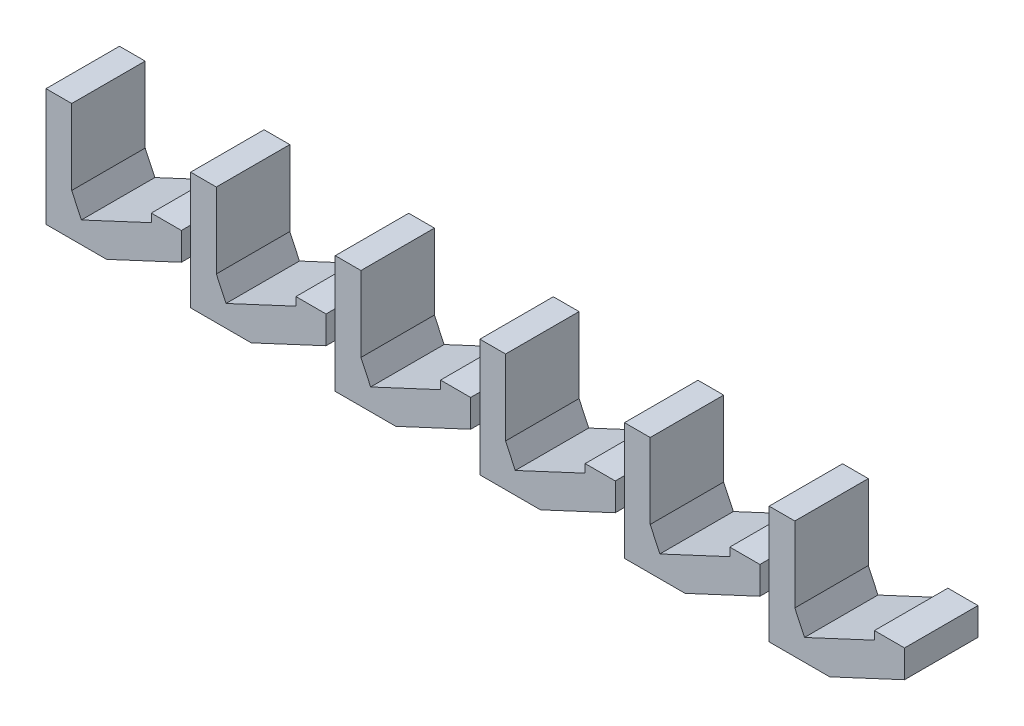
ISO-10303-21;
HEADER;
FILE_DESCRIPTION(('STEP AP214'),'2;1');
FILE_NAME('part.step','',(''),(''),'','','');
FILE_SCHEMA(('AUTOMOTIVE_DESIGN { 1 0 10303 214 1 1 1 1 }'));
ENDSEC;
DATA;
#1=APPLICATION_CONTEXT('core data for automotive mechanical design processes');
#2=APPLICATION_PROTOCOL_DEFINITION('international standard','automotive_design',2000,#1);
#3=PRODUCT_CONTEXT('',#1,'mechanical');
#4=PRODUCT('Part','Part','',(#3));
#5=PRODUCT_RELATED_PRODUCT_CATEGORY('part','',(#4));
#6=PRODUCT_DEFINITION_FORMATION('','',#4);
#7=PRODUCT_DEFINITION_CONTEXT('part definition',#1,'design');
#8=PRODUCT_DEFINITION('design','',#6,#7);
#9=PRODUCT_DEFINITION_SHAPE('','',#8);
#10=(LENGTH_UNIT() NAMED_UNIT(*) SI_UNIT(.MILLI.,.METRE.));
#11=(NAMED_UNIT(*) PLANE_ANGLE_UNIT() SI_UNIT($,.RADIAN.));
#12=(NAMED_UNIT(*) SI_UNIT($,.STERADIAN.) SOLID_ANGLE_UNIT());
#13=UNCERTAINTY_MEASURE_WITH_UNIT(LENGTH_MEASURE(1.E-05),#10,'distance_accuracy_value','');
#14=(GEOMETRIC_REPRESENTATION_CONTEXT(3) GLOBAL_UNCERTAINTY_ASSIGNED_CONTEXT((#13)) GLOBAL_UNIT_ASSIGNED_CONTEXT((#10,
#11,#12)) REPRESENTATION_CONTEXT('',''));
#15=CARTESIAN_POINT('',(0.,0.,0.));
#16=DIRECTION('',(0.,0.,1.));
#17=DIRECTION('',(1.,0.,0.));
#18=AXIS2_PLACEMENT_3D('',#15,#16,#17);
#19=CARTESIAN_POINT('',(-140.498922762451,58.8040295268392,25.4));
#20=DIRECTION('',(0.,1.,0.));
#21=DIRECTION('',(-1.,0.,0.));
#22=AXIS2_PLACEMENT_3D('',#19,#20,#21);
#23=PLANE('',#22);
#24=DIRECTION('',(1.,0.,0.));
#25=VECTOR('',#24,1.);
#26=CARTESIAN_POINT('',(-140.498922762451,58.8040295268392,0.));
#27=LINE('',#26,#25);
#28=CARTESIAN_POINT('',(-187.314665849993,58.8040295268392,0.));
#29=VERTEX_POINT('',#28);
#30=CARTESIAN_POINT('',(-166.3723987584,58.8040295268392,0.));
#31=VERTEX_POINT('',#30);
#32=EDGE_CURVE('E202',#29,#31,#27,.T.);
#33=ORIENTED_EDGE('',*,*,#32,.T.);
#34=DIRECTION('',(0.,0.,1.));
#35=VECTOR('',#34,1.);
#36=CARTESIAN_POINT('',(-166.3723987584,58.8040295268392,0.));
#37=LINE('',#36,#35);
#38=CARTESIAN_POINT('',(-166.3723987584,58.8040295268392,25.4));
#39=VERTEX_POINT('',#38);
#40=EDGE_CURVE('E54',#31,#39,#37,.T.);
#41=ORIENTED_EDGE('',*,*,#40,.T.);
#42=DIRECTION('',(1.,0.,0.));
#43=VECTOR('',#42,1.);
#44=CARTESIAN_POINT('',(-140.498922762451,58.8040295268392,25.4));
#45=LINE('',#44,#43);
#46=CARTESIAN_POINT('',(-187.314665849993,58.8040295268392,25.4));
#47=VERTEX_POINT('',#46);
#48=EDGE_CURVE('E128',#47,#39,#45,.T.);
#49=ORIENTED_EDGE('',*,*,#48,.F.);
#50=DIRECTION('',(0.,0.,-1.));
#51=VECTOR('',#50,1.);
#52=CARTESIAN_POINT('',(-187.314665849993,58.8040295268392,25.4));
#53=LINE('',#52,#51);
#54=EDGE_CURVE('E150',#47,#29,#53,.T.);
#55=ORIENTED_EDGE('',*,*,#54,.T.);
#56=EDGE_LOOP('',(#33,#41,#49,#55));
#57=FACE_BOUND('',#56,.T.);
#58=ADVANCED_FACE('F40',(#57),#23,.F.);
#59=CARTESIAN_POINT('',(-140.498922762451,80.3940295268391,25.4));
#60=DIRECTION('',(-1.,0.,0.));
#61=DIRECTION('',(0.,-1.,0.));
#62=AXIS2_PLACEMENT_3D('',#59,#60,#61);
#63=PLANE('',#62);
#64=DIRECTION('',(0.,1.,0.));
#65=VECTOR('',#64,1.);
#66=CARTESIAN_POINT('',(-140.498922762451,80.3940295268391,25.4));
#67=LINE('',#66,#65);
#68=CARTESIAN_POINT('',(-140.498922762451,70.8690295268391,25.4));
#69=VERTEX_POINT('',#68);
#70=CARTESIAN_POINT('',(-140.498922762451,80.3940295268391,25.4));
#71=VERTEX_POINT('',#70);
#72=EDGE_CURVE('E125',#69,#71,#67,.T.);
#73=ORIENTED_EDGE('',*,*,#72,.F.);
#74=DIRECTION('',(0.,0.,1.));
#75=VECTOR('',#74,1.);
#76=CARTESIAN_POINT('',(-140.498922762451,70.8690295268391,0.));
#77=LINE('',#76,#75);
#78=CARTESIAN_POINT('',(-140.498922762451,70.8690295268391,0.));
#79=VERTEX_POINT('',#78);
#80=EDGE_CURVE('E115',#79,#69,#77,.T.);
#81=ORIENTED_EDGE('',*,*,#80,.F.);
#82=DIRECTION('',(0.,1.,0.));
#83=VECTOR('',#82,1.);
#84=CARTESIAN_POINT('',(-140.498922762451,80.3940295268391,0.));
#85=LINE('',#84,#83);
#86=CARTESIAN_POINT('',(-140.498922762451,80.3940295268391,0.));
#87=VERTEX_POINT('',#86);
#88=EDGE_CURVE('E186',#79,#87,#85,.T.);
#89=ORIENTED_EDGE('',*,*,#88,.T.);
#90=DIRECTION('',(0.,0.,-1.));
#91=VECTOR('',#90,1.);
#92=CARTESIAN_POINT('',(-140.498922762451,80.3940295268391,25.4));
#93=LINE('',#92,#91);
#94=EDGE_CURVE('E12',#71,#87,#93,.T.);
#95=ORIENTED_EDGE('',*,*,#94,.F.);
#96=EDGE_LOOP('',(#73,#81,#89,#95));
#97=FACE_BOUND('',#96,.T.);
#98=ADVANCED_FACE('F130',(#97),#63,.F.);
#99=CARTESIAN_POINT('',(-150.912922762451,80.3940295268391,25.4));
#100=DIRECTION('',(0.,-1.,0.));
#101=DIRECTION('',(0.,0.,-1.));
#102=AXIS2_PLACEMENT_3D('',#99,#100,#101);
#103=PLANE('',#102);
#104=DIRECTION('',(-1.,0.,0.));
#105=VECTOR('',#104,1.);
#106=CARTESIAN_POINT('',(-150.912922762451,80.3940295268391,0.));
#107=LINE('',#106,#105);
#108=CARTESIAN_POINT('',(-150.912922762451,80.3940295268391,0.));
#109=VERTEX_POINT('',#108);
#110=EDGE_CURVE('E180',#87,#109,#107,.T.);
#111=ORIENTED_EDGE('',*,*,#110,.T.);
#112=DIRECTION('',(0.,0.,-1.));
#113=VECTOR('',#112,1.);
#114=CARTESIAN_POINT('',(-150.912922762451,80.3940295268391,25.4));
#115=LINE('',#114,#113);
#116=CARTESIAN_POINT('',(-150.912922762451,80.3940295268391,25.4));
#117=VERTEX_POINT('',#116);
#118=EDGE_CURVE('E47',#117,#109,#115,.T.);
#119=ORIENTED_EDGE('',*,*,#118,.F.);
#120=DIRECTION('',(-1.,0.,0.));
#121=VECTOR('',#120,1.);
#122=CARTESIAN_POINT('',(-150.912922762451,80.3940295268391,25.4));
#123=LINE('',#122,#121);
#124=EDGE_CURVE('E132',#71,#117,#123,.T.);
#125=ORIENTED_EDGE('',*,*,#124,.F.);
#126=ORIENTED_EDGE('',*,*,#94,.T.);
#127=EDGE_LOOP('',(#111,#119,#125,#126));
#128=FACE_BOUND('',#127,.T.);
#129=ADVANCED_FACE('F206',(#128),#103,.F.);
#130=CARTESIAN_POINT('',(-150.912922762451,77.5165023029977,25.4));
#131=DIRECTION('',(1.,0.,0.));
#132=DIRECTION('',(0.,0.,-1.));
#133=AXIS2_PLACEMENT_3D('',#130,#131,#132);
#134=PLANE('',#133);
#135=DIRECTION('',(0.,-1.,0.));
#136=VECTOR('',#135,1.);
#137=CARTESIAN_POINT('',(-150.912922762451,77.5165023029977,0.));
#138=LINE('',#137,#136);
#139=CARTESIAN_POINT('',(-150.912922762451,77.5165023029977,0.));
#140=VERTEX_POINT('',#139);
#141=EDGE_CURVE('E174',#109,#140,#138,.T.);
#142=ORIENTED_EDGE('',*,*,#141,.T.);
#143=DIRECTION('',(0.,0.,-1.));
#144=VECTOR('',#143,1.);
#145=CARTESIAN_POINT('',(-150.912922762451,77.5165023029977,25.4));
#146=LINE('',#145,#144);
#147=CARTESIAN_POINT('',(-150.912922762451,77.5165023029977,25.4));
#148=VERTEX_POINT('',#147);
#149=EDGE_CURVE('E165',#148,#140,#146,.T.);
#150=ORIENTED_EDGE('',*,*,#149,.F.);
#151=DIRECTION('',(0.,-1.,0.));
#152=VECTOR('',#151,1.);
#153=CARTESIAN_POINT('',(-150.912922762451,77.5165023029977,25.4));
#154=LINE('',#153,#152);
#155=EDGE_CURVE('E134',#117,#148,#154,.T.);
#156=ORIENTED_EDGE('',*,*,#155,.F.);
#157=ORIENTED_EDGE('',*,*,#118,.T.);
#158=EDGE_LOOP('',(#142,#150,#156,#157));
#159=FACE_BOUND('',#158,.T.);
#160=ADVANCED_FACE('F172',(#159),#134,.F.);
#161=CARTESIAN_POINT('',(-150.912922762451,77.5165023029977,25.4));
#162=DIRECTION('',(0.422618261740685,-0.906307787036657,0.));
#163=DIRECTION('',(0.906307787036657,0.422618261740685,0.));
#164=AXIS2_PLACEMENT_3D('',#161,#162,#163);
#165=PLANE('',#164);
#166=DIRECTION('',(-0.906307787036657,-0.422618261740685,0.));
#167=VECTOR('',#166,1.);
#168=CARTESIAN_POINT('',(-150.912922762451,77.5165023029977,0.));
#169=LINE('',#168,#167);
#170=CARTESIAN_POINT('',(-175.084151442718,66.2452732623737,0.));
#171=VERTEX_POINT('',#170);
#172=EDGE_CURVE('E182',#140,#171,#169,.T.);
#173=ORIENTED_EDGE('',*,*,#172,.T.);
#174=DIRECTION('',(0.,0.,-1.));
#175=VECTOR('',#174,1.);
#176=CARTESIAN_POINT('',(-175.084151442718,66.2452732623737,25.4));
#177=LINE('',#176,#175);
#178=CARTESIAN_POINT('',(-175.084151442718,66.2452732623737,25.4));
#179=VERTEX_POINT('',#178);
#180=EDGE_CURVE('E162',#179,#171,#177,.T.);
#181=ORIENTED_EDGE('',*,*,#180,.F.);
#182=DIRECTION('',(-0.906307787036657,-0.422618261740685,0.));
#183=VECTOR('',#182,1.);
#184=CARTESIAN_POINT('',(-150.912922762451,77.5165023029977,25.4));
#185=LINE('',#184,#183);
#186=EDGE_CURVE('E141',#148,#179,#185,.T.);
#187=ORIENTED_EDGE('',*,*,#186,.F.);
#188=ORIENTED_EDGE('',*,*,#149,.T.);
#189=EDGE_LOOP('',(#173,#181,#187,#188));
#190=FACE_BOUND('',#189,.T.);
#191=ADVANCED_FACE('F210',(#190),#165,.F.);
#192=CARTESIAN_POINT('',(-176.425964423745,69.1228004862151,25.4));
#193=DIRECTION('',(-0.906307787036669,-0.422618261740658,0.));
#194=DIRECTION('',(0.422618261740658,-0.906307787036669,0.));
#195=AXIS2_PLACEMENT_3D('',#192,#193,#194);
#196=PLANE('',#195);
#197=DIRECTION('',(-0.422618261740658,0.906307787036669,0.));
#198=VECTOR('',#197,1.);
#199=CARTESIAN_POINT('',(-176.425964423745,69.1228004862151,0.));
#200=LINE('',#199,#198);
#201=CARTESIAN_POINT('',(-178.424665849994,73.4090295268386,0.));
#202=VERTEX_POINT('',#201);
#203=EDGE_CURVE('E184',#171,#202,#200,.T.);
#204=ORIENTED_EDGE('',*,*,#203,.T.);
#205=DIRECTION('',(0.,0.,-1.));
#206=VECTOR('',#205,1.);
#207=CARTESIAN_POINT('',(-178.424665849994,73.4090295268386,25.4));
#208=LINE('',#207,#206);
#209=CARTESIAN_POINT('',(-178.424665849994,73.4090295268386,25.4));
#210=VERTEX_POINT('',#209);
#211=EDGE_CURVE('E159',#210,#202,#208,.T.);
#212=ORIENTED_EDGE('',*,*,#211,.F.);
#213=DIRECTION('',(-0.422618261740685,0.906307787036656,0.));
#214=VECTOR('',#213,1.);
#215=CARTESIAN_POINT('',(-175.084151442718,66.2452732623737,25.4));
#216=LINE('',#215,#214);
#217=EDGE_CURVE('E143',#179,#210,#216,.T.);
#218=ORIENTED_EDGE('',*,*,#217,.F.);
#219=ORIENTED_EDGE('',*,*,#180,.T.);
#220=EDGE_LOOP('',(#204,#212,#218,#219));
#221=FACE_BOUND('',#220,.T.);
#222=ADVANCED_FACE('F214',(#221),#196,.F.);
#223=CARTESIAN_POINT('',(-178.424665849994,73.4090295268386,25.4));
#224=DIRECTION('',(-1.,0.,0.));
#225=DIRECTION('',(0.,-1.,0.));
#226=AXIS2_PLACEMENT_3D('',#223,#224,#225);
#227=PLANE('',#226);
#228=DIRECTION('',(0.,1.,0.));
#229=VECTOR('',#228,1.);
#230=CARTESIAN_POINT('',(-178.424665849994,73.4090295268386,0.));
#231=LINE('',#230,#229);
#232=CARTESIAN_POINT('',(-178.424665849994,99.4440295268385,0.));
#233=VERTEX_POINT('',#232);
#234=EDGE_CURVE('E191',#202,#233,#231,.T.);
#235=ORIENTED_EDGE('',*,*,#234,.T.);
#236=DIRECTION('',(0.,0.,-1.));
#237=VECTOR('',#236,1.);
#238=CARTESIAN_POINT('',(-178.424665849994,99.4440295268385,25.4));
#239=LINE('',#238,#237);
#240=CARTESIAN_POINT('',(-178.424665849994,99.4440295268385,25.4));
#241=VERTEX_POINT('',#240);
#242=EDGE_CURVE('E156',#241,#233,#239,.T.);
#243=ORIENTED_EDGE('',*,*,#242,.F.);
#244=DIRECTION('',(0.,1.,0.));
#245=VECTOR('',#244,1.);
#246=CARTESIAN_POINT('',(-178.424665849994,73.4090295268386,25.4));
#247=LINE('',#246,#245);
#248=EDGE_CURVE('E145',#210,#241,#247,.T.);
#249=ORIENTED_EDGE('',*,*,#248,.F.);
#250=ORIENTED_EDGE('',*,*,#211,.T.);
#251=EDGE_LOOP('',(#235,#243,#249,#250));
#252=FACE_BOUND('',#251,.T.);
#253=ADVANCED_FACE('F219',(#252),#227,.F.);
#254=CARTESIAN_POINT('',(-178.424665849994,99.4440295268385,25.4));
#255=DIRECTION('',(0.,-1.,0.));
#256=DIRECTION('',(1.,0.,0.));
#257=AXIS2_PLACEMENT_3D('',#254,#255,#256);
#258=PLANE('',#257);
#259=DIRECTION('',(-1.,0.,0.));
#260=VECTOR('',#259,1.);
#261=CARTESIAN_POINT('',(-178.424665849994,99.4440295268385,0.));
#262=LINE('',#261,#260);
#263=CARTESIAN_POINT('',(-187.314665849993,99.4440295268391,0.));
#264=VERTEX_POINT('',#263);
#265=EDGE_CURVE('E193',#233,#264,#262,.T.);
#266=ORIENTED_EDGE('',*,*,#265,.T.);
#267=DIRECTION('',(0.,0.,-1.));
#268=VECTOR('',#267,1.);
#269=CARTESIAN_POINT('',(-187.314665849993,99.4440295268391,25.4));
#270=LINE('',#269,#268);
#271=CARTESIAN_POINT('',(-187.314665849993,99.4440295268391,25.4));
#272=VERTEX_POINT('',#271);
#273=EDGE_CURVE('E153',#272,#264,#270,.T.);
#274=ORIENTED_EDGE('',*,*,#273,.F.);
#275=DIRECTION('',(-1.,0.,0.));
#276=VECTOR('',#275,1.);
#277=CARTESIAN_POINT('',(-178.424665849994,99.4440295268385,25.4));
#278=LINE('',#277,#276);
#279=EDGE_CURVE('E147',#241,#272,#278,.T.);
#280=ORIENTED_EDGE('',*,*,#279,.F.);
#281=ORIENTED_EDGE('',*,*,#242,.T.);
#282=EDGE_LOOP('',(#266,#274,#280,#281));
#283=FACE_BOUND('',#282,.T.);
#284=ADVANCED_FACE('F222',(#283),#258,.F.);
#285=CARTESIAN_POINT('',(-187.314665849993,99.4440295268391,25.4));
#286=DIRECTION('',(1.,0.,0.));
#287=DIRECTION('',(0.,0.,-1.));
#288=AXIS2_PLACEMENT_3D('',#285,#286,#287);
#289=PLANE('',#288);
#290=DIRECTION('',(0.,-1.,0.));
#291=VECTOR('',#290,1.);
#292=CARTESIAN_POINT('',(-187.314665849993,99.4440295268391,0.));
#293=LINE('',#292,#291);
#294=EDGE_CURVE('E136',#264,#29,#293,.T.);
#295=ORIENTED_EDGE('',*,*,#294,.T.);
#296=ORIENTED_EDGE('',*,*,#54,.F.);
#297=DIRECTION('',(0.,-1.,0.));
#298=VECTOR('',#297,1.);
#299=CARTESIAN_POINT('',(-187.314665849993,99.4440295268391,25.4));
#300=LINE('',#299,#298);
#301=EDGE_CURVE('E62',#272,#47,#300,.T.);
#302=ORIENTED_EDGE('',*,*,#301,.F.);
#303=ORIENTED_EDGE('',*,*,#273,.T.);
#304=EDGE_LOOP('',(#295,#296,#302,#303));
#305=FACE_BOUND('',#304,.T.);
#306=ADVANCED_FACE('F196',(#305),#289,.F.);
#307=CARTESIAN_POINT('',(-187.314665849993,58.8040295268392,25.4));
#308=DIRECTION('',(0.,0.,1.));
#309=DIRECTION('',(1.,0.,0.));
#310=AXIS2_PLACEMENT_3D('',#307,#308,#309);
#311=PLANE('',#310);
#312=DIRECTION('',(-0.906307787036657,-0.422618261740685,0.));
#313=VECTOR('',#312,1.);
#314=CARTESIAN_POINT('',(-140.498922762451,70.8690295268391,25.4));
#315=LINE('',#314,#313);
#316=EDGE_CURVE('E118',#69,#39,#315,.T.);
#317=ORIENTED_EDGE('',*,*,#316,.F.);
#318=ORIENTED_EDGE('',*,*,#72,.T.);
#319=ORIENTED_EDGE('',*,*,#124,.T.);
#320=ORIENTED_EDGE('',*,*,#155,.T.);
#321=ORIENTED_EDGE('',*,*,#186,.T.);
#322=ORIENTED_EDGE('',*,*,#217,.T.);
#323=ORIENTED_EDGE('',*,*,#248,.T.);
#324=ORIENTED_EDGE('',*,*,#279,.T.);
#325=ORIENTED_EDGE('',*,*,#301,.T.);
#326=ORIENTED_EDGE('',*,*,#48,.T.);
#327=EDGE_LOOP('',(#317,#318,#319,#320,#321,#322,#323,#324,#325,#326));
#328=FACE_BOUND('',#327,.T.);
#329=ADVANCED_FACE('F124',(#328),#311,.T.);
#330=CARTESIAN_POINT('',(-187.314665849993,58.8040295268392,0.));
#331=DIRECTION('',(0.,0.,1.));
#332=DIRECTION('',(1.,0.,0.));
#333=AXIS2_PLACEMENT_3D('',#330,#331,#332);
#334=PLANE('',#333);
#335=ORIENTED_EDGE('',*,*,#88,.F.);
#336=DIRECTION('',(-0.906307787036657,-0.422618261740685,0.));
#337=VECTOR('',#336,1.);
#338=CARTESIAN_POINT('',(-140.498922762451,70.8690295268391,0.));
#339=LINE('',#338,#337);
#340=EDGE_CURVE('E119',#79,#31,#339,.T.);
#341=ORIENTED_EDGE('',*,*,#340,.T.);
#342=ORIENTED_EDGE('',*,*,#32,.F.);
#343=ORIENTED_EDGE('',*,*,#294,.F.);
#344=ORIENTED_EDGE('',*,*,#265,.F.);
#345=ORIENTED_EDGE('',*,*,#234,.F.);
#346=ORIENTED_EDGE('',*,*,#203,.F.);
#347=ORIENTED_EDGE('',*,*,#172,.F.);
#348=ORIENTED_EDGE('',*,*,#141,.F.);
#349=ORIENTED_EDGE('',*,*,#110,.F.);
#350=EDGE_LOOP('',(#335,#341,#342,#343,#344,#345,#346,#347,#348,#349));
#351=FACE_BOUND('',#350,.T.);
#352=ADVANCED_FACE('F179',(#351),#334,.F.);
#353=CARTESIAN_POINT('',(-140.498922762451,70.8690295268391,0.));
#354=DIRECTION('',(-0.422618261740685,0.906307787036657,0.));
#355=DIRECTION('',(-0.906307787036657,-0.422618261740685,0.));
#356=AXIS2_PLACEMENT_3D('',#353,#354,#355);
#357=PLANE('',#356);
#358=ORIENTED_EDGE('',*,*,#316,.T.);
#359=ORIENTED_EDGE('',*,*,#40,.F.);
#360=ORIENTED_EDGE('',*,*,#340,.F.);
#361=ORIENTED_EDGE('',*,*,#80,.T.);
#362=EDGE_LOOP('',(#358,#359,#360,#361));
#363=FACE_BOUND('',#362,.T.);
#364=ADVANCED_FACE('F117',(#363),#357,.F.);
#365=CLOSED_SHELL('',(#58,#98,#129,#160,#191,#222,#253,#284,#306,#329,#352,#364));
#366=MANIFOLD_SOLID_BREP('B2',#365);
#367=CARTESIAN_POINT('',(-90.4989227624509,58.8040295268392,25.4));
#368=DIRECTION('',(0.,1.,0.));
#369=DIRECTION('',(-1.,0.,0.));
#370=AXIS2_PLACEMENT_3D('',#367,#368,#369);
#371=PLANE('',#370);
#372=DIRECTION('',(1.,0.,0.));
#373=VECTOR('',#372,1.);
#374=CARTESIAN_POINT('',(-90.4989227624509,58.8040295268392,0.));
#375=LINE('',#374,#373);
#376=CARTESIAN_POINT('',(-137.314665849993,58.8040295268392,0.));
#377=VERTEX_POINT('',#376);
#378=CARTESIAN_POINT('',(-116.3723987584,58.8040295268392,0.));
#379=VERTEX_POINT('',#378);
#380=EDGE_CURVE('E471',#377,#379,#375,.T.);
#381=ORIENTED_EDGE('',*,*,#380,.T.);
#382=DIRECTION('',(0.,0.,1.));
#383=VECTOR('',#382,1.);
#384=CARTESIAN_POINT('',(-116.3723987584,58.8040295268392,0.));
#385=LINE('',#384,#383);
#386=CARTESIAN_POINT('',(-116.3723987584,58.8040295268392,25.4));
#387=VERTEX_POINT('',#386);
#388=EDGE_CURVE('E323',#379,#387,#385,.T.);
#389=ORIENTED_EDGE('',*,*,#388,.T.);
#390=DIRECTION('',(1.,0.,0.));
#391=VECTOR('',#390,1.);
#392=CARTESIAN_POINT('',(-90.4989227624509,58.8040295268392,25.4));
#393=LINE('',#392,#391);
#394=CARTESIAN_POINT('',(-137.314665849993,58.8040295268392,25.4));
#395=VERTEX_POINT('',#394);
#396=EDGE_CURVE('E397',#395,#387,#393,.T.);
#397=ORIENTED_EDGE('',*,*,#396,.F.);
#398=DIRECTION('',(0.,0.,-1.));
#399=VECTOR('',#398,1.);
#400=CARTESIAN_POINT('',(-137.314665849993,58.8040295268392,25.4));
#401=LINE('',#400,#399);
#402=EDGE_CURVE('E419',#395,#377,#401,.T.);
#403=ORIENTED_EDGE('',*,*,#402,.T.);
#404=EDGE_LOOP('',(#381,#389,#397,#403));
#405=FACE_BOUND('',#404,.T.);
#406=ADVANCED_FACE('F309',(#405),#371,.F.);
#407=CARTESIAN_POINT('',(-90.4989227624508,80.3940295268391,25.4));
#408=DIRECTION('',(-1.,0.,0.));
#409=DIRECTION('',(0.,-1.,0.));
#410=AXIS2_PLACEMENT_3D('',#407,#408,#409);
#411=PLANE('',#410);
#412=DIRECTION('',(0.,1.,0.));
#413=VECTOR('',#412,1.);
#414=CARTESIAN_POINT('',(-90.4989227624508,80.3940295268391,25.4));
#415=LINE('',#414,#413);
#416=CARTESIAN_POINT('',(-90.4989227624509,70.8690295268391,25.4));
#417=VERTEX_POINT('',#416);
#418=CARTESIAN_POINT('',(-90.4989227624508,80.3940295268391,25.4));
#419=VERTEX_POINT('',#418);
#420=EDGE_CURVE('E394',#417,#419,#415,.T.);
#421=ORIENTED_EDGE('',*,*,#420,.F.);
#422=DIRECTION('',(0.,0.,1.));
#423=VECTOR('',#422,1.);
#424=CARTESIAN_POINT('',(-90.4989227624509,70.8690295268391,0.));
#425=LINE('',#424,#423);
#426=CARTESIAN_POINT('',(-90.4989227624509,70.8690295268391,0.));
#427=VERTEX_POINT('',#426);
#428=EDGE_CURVE('E384',#427,#417,#425,.T.);
#429=ORIENTED_EDGE('',*,*,#428,.F.);
#430=DIRECTION('',(0.,1.,0.));
#431=VECTOR('',#430,1.);
#432=CARTESIAN_POINT('',(-90.4989227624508,80.3940295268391,0.));
#433=LINE('',#432,#431);
#434=CARTESIAN_POINT('',(-90.4989227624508,80.3940295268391,0.));
#435=VERTEX_POINT('',#434);
#436=EDGE_CURVE('E455',#427,#435,#433,.T.);
#437=ORIENTED_EDGE('',*,*,#436,.T.);
#438=DIRECTION('',(0.,0.,-1.));
#439=VECTOR('',#438,1.);
#440=CARTESIAN_POINT('',(-90.4989227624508,80.3940295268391,25.4));
#441=LINE('',#440,#439);
#442=EDGE_CURVE('E38',#419,#435,#441,.T.);
#443=ORIENTED_EDGE('',*,*,#442,.F.);
#444=EDGE_LOOP('',(#421,#429,#437,#443));
#445=FACE_BOUND('',#444,.T.);
#446=ADVANCED_FACE('F399',(#445),#411,.F.);
#447=CARTESIAN_POINT('',(-100.912922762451,80.3940295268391,25.4));
#448=DIRECTION('',(0.,-1.,0.));
#449=DIRECTION('',(0.,0.,-1.));
#450=AXIS2_PLACEMENT_3D('',#447,#448,#449);
#451=PLANE('',#450);
#452=DIRECTION('',(-1.,0.,0.));
#453=VECTOR('',#452,1.);
#454=CARTESIAN_POINT('',(-100.912922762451,80.3940295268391,0.));
#455=LINE('',#454,#453);
#456=CARTESIAN_POINT('',(-100.912922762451,80.3940295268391,0.));
#457=VERTEX_POINT('',#456);
#458=EDGE_CURVE('E449',#435,#457,#455,.T.);
#459=ORIENTED_EDGE('',*,*,#458,.T.);
#460=DIRECTION('',(0.,0.,-1.));
#461=VECTOR('',#460,1.);
#462=CARTESIAN_POINT('',(-100.912922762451,80.3940295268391,25.4));
#463=LINE('',#462,#461);
#464=CARTESIAN_POINT('',(-100.912922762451,80.3940295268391,25.4));
#465=VERTEX_POINT('',#464);
#466=EDGE_CURVE('E316',#465,#457,#463,.T.);
#467=ORIENTED_EDGE('',*,*,#466,.F.);
#468=DIRECTION('',(-1.,0.,0.));
#469=VECTOR('',#468,1.);
#470=CARTESIAN_POINT('',(-100.912922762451,80.3940295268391,25.4));
#471=LINE('',#470,#469);
#472=EDGE_CURVE('E401',#419,#465,#471,.T.);
#473=ORIENTED_EDGE('',*,*,#472,.F.);
#474=ORIENTED_EDGE('',*,*,#442,.T.);
#475=EDGE_LOOP('',(#459,#467,#473,#474));
#476=FACE_BOUND('',#475,.T.);
#477=ADVANCED_FACE('F475',(#476),#451,.F.);
#478=CARTESIAN_POINT('',(-100.912922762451,77.5165023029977,25.4));
#479=DIRECTION('',(1.,0.,0.));
#480=DIRECTION('',(0.,0.,-1.));
#481=AXIS2_PLACEMENT_3D('',#478,#479,#480);
#482=PLANE('',#481);
#483=DIRECTION('',(0.,-1.,0.));
#484=VECTOR('',#483,1.);
#485=CARTESIAN_POINT('',(-100.912922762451,77.5165023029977,0.));
#486=LINE('',#485,#484);
#487=CARTESIAN_POINT('',(-100.912922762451,77.5165023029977,0.));
#488=VERTEX_POINT('',#487);
#489=EDGE_CURVE('E443',#457,#488,#486,.T.);
#490=ORIENTED_EDGE('',*,*,#489,.T.);
#491=DIRECTION('',(0.,0.,-1.));
#492=VECTOR('',#491,1.);
#493=CARTESIAN_POINT('',(-100.912922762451,77.5165023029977,25.4));
#494=LINE('',#493,#492);
#495=CARTESIAN_POINT('',(-100.912922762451,77.5165023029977,25.4));
#496=VERTEX_POINT('',#495);
#497=EDGE_CURVE('E434',#496,#488,#494,.T.);
#498=ORIENTED_EDGE('',*,*,#497,.F.);
#499=DIRECTION('',(0.,-1.,0.));
#500=VECTOR('',#499,1.);
#501=CARTESIAN_POINT('',(-100.912922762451,77.5165023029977,25.4));
#502=LINE('',#501,#500);
#503=EDGE_CURVE('E403',#465,#496,#502,.T.);
#504=ORIENTED_EDGE('',*,*,#503,.F.);
#505=ORIENTED_EDGE('',*,*,#466,.T.);
#506=EDGE_LOOP('',(#490,#498,#504,#505));
#507=FACE_BOUND('',#506,.T.);
#508=ADVANCED_FACE('F441',(#507),#482,.F.);
#509=CARTESIAN_POINT('',(-100.912922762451,77.5165023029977,25.4));
#510=DIRECTION('',(0.422618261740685,-0.906307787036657,0.));
#511=DIRECTION('',(0.906307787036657,0.422618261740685,0.));
#512=AXIS2_PLACEMENT_3D('',#509,#510,#511);
#513=PLANE('',#512);
#514=DIRECTION('',(-0.906307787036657,-0.422618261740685,0.));
#515=VECTOR('',#514,1.);
#516=CARTESIAN_POINT('',(-100.912922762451,77.5165023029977,0.));
#517=LINE('',#516,#515);
#518=CARTESIAN_POINT('',(-125.084151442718,66.2452732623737,0.));
#519=VERTEX_POINT('',#518);
#520=EDGE_CURVE('E451',#488,#519,#517,.T.);
#521=ORIENTED_EDGE('',*,*,#520,.T.);
#522=DIRECTION('',(0.,0.,-1.));
#523=VECTOR('',#522,1.);
#524=CARTESIAN_POINT('',(-125.084151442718,66.2452732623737,25.4));
#525=LINE('',#524,#523);
#526=CARTESIAN_POINT('',(-125.084151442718,66.2452732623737,25.4));
#527=VERTEX_POINT('',#526);
#528=EDGE_CURVE('E431',#527,#519,#525,.T.);
#529=ORIENTED_EDGE('',*,*,#528,.F.);
#530=DIRECTION('',(-0.906307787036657,-0.422618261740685,0.));
#531=VECTOR('',#530,1.);
#532=CARTESIAN_POINT('',(-100.912922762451,77.5165023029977,25.4));
#533=LINE('',#532,#531);
#534=EDGE_CURVE('E410',#496,#527,#533,.T.);
#535=ORIENTED_EDGE('',*,*,#534,.F.);
#536=ORIENTED_EDGE('',*,*,#497,.T.);
#537=EDGE_LOOP('',(#521,#529,#535,#536));
#538=FACE_BOUND('',#537,.T.);
#539=ADVANCED_FACE('F479',(#538),#513,.F.);
#540=CARTESIAN_POINT('',(-126.425964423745,69.1228004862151,25.4));
#541=DIRECTION('',(-0.906307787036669,-0.422618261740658,0.));
#542=DIRECTION('',(0.422618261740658,-0.906307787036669,0.));
#543=AXIS2_PLACEMENT_3D('',#540,#541,#542);
#544=PLANE('',#543);
#545=DIRECTION('',(-0.422618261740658,0.906307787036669,0.));
#546=VECTOR('',#545,1.);
#547=CARTESIAN_POINT('',(-126.425964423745,69.1228004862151,0.));
#548=LINE('',#547,#546);
#549=CARTESIAN_POINT('',(-128.424665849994,73.4090295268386,0.));
#550=VERTEX_POINT('',#549);
#551=EDGE_CURVE('E453',#519,#550,#548,.T.);
#552=ORIENTED_EDGE('',*,*,#551,.T.);
#553=DIRECTION('',(0.,0.,-1.));
#554=VECTOR('',#553,1.);
#555=CARTESIAN_POINT('',(-128.424665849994,73.4090295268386,25.4));
#556=LINE('',#555,#554);
#557=CARTESIAN_POINT('',(-128.424665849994,73.4090295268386,25.4));
#558=VERTEX_POINT('',#557);
#559=EDGE_CURVE('E428',#558,#550,#556,.T.);
#560=ORIENTED_EDGE('',*,*,#559,.F.);
#561=DIRECTION('',(-0.422618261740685,0.906307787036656,0.));
#562=VECTOR('',#561,1.);
#563=CARTESIAN_POINT('',(-125.084151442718,66.2452732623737,25.4));
#564=LINE('',#563,#562);
#565=EDGE_CURVE('E412',#527,#558,#564,.T.);
#566=ORIENTED_EDGE('',*,*,#565,.F.);
#567=ORIENTED_EDGE('',*,*,#528,.T.);
#568=EDGE_LOOP('',(#552,#560,#566,#567));
#569=FACE_BOUND('',#568,.T.);
#570=ADVANCED_FACE('F483',(#569),#544,.F.);
#571=CARTESIAN_POINT('',(-128.424665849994,73.4090295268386,25.4));
#572=DIRECTION('',(-1.,0.,0.));
#573=DIRECTION('',(0.,-1.,0.));
#574=AXIS2_PLACEMENT_3D('',#571,#572,#573);
#575=PLANE('',#574);
#576=DIRECTION('',(0.,1.,0.));
#577=VECTOR('',#576,1.);
#578=CARTESIAN_POINT('',(-128.424665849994,73.4090295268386,0.));
#579=LINE('',#578,#577);
#580=CARTESIAN_POINT('',(-128.424665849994,99.4440295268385,0.));
#581=VERTEX_POINT('',#580);
#582=EDGE_CURVE('E460',#550,#581,#579,.T.);
#583=ORIENTED_EDGE('',*,*,#582,.T.);
#584=DIRECTION('',(0.,0.,-1.));
#585=VECTOR('',#584,1.);
#586=CARTESIAN_POINT('',(-128.424665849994,99.4440295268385,25.4));
#587=LINE('',#586,#585);
#588=CARTESIAN_POINT('',(-128.424665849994,99.4440295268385,25.4));
#589=VERTEX_POINT('',#588);
#590=EDGE_CURVE('E425',#589,#581,#587,.T.);
#591=ORIENTED_EDGE('',*,*,#590,.F.);
#592=DIRECTION('',(0.,1.,0.));
#593=VECTOR('',#592,1.);
#594=CARTESIAN_POINT('',(-128.424665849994,73.4090295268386,25.4));
#595=LINE('',#594,#593);
#596=EDGE_CURVE('E414',#558,#589,#595,.T.);
#597=ORIENTED_EDGE('',*,*,#596,.F.);
#598=ORIENTED_EDGE('',*,*,#559,.T.);
#599=EDGE_LOOP('',(#583,#591,#597,#598));
#600=FACE_BOUND('',#599,.T.);
#601=ADVANCED_FACE('F488',(#600),#575,.F.);
#602=CARTESIAN_POINT('',(-128.424665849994,99.4440295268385,25.4));
#603=DIRECTION('',(0.,-1.,0.));
#604=DIRECTION('',(1.,0.,0.));
#605=AXIS2_PLACEMENT_3D('',#602,#603,#604);
#606=PLANE('',#605);
#607=DIRECTION('',(-1.,0.,0.));
#608=VECTOR('',#607,1.);
#609=CARTESIAN_POINT('',(-128.424665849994,99.4440295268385,0.));
#610=LINE('',#609,#608);
#611=CARTESIAN_POINT('',(-137.314665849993,99.4440295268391,0.));
#612=VERTEX_POINT('',#611);
#613=EDGE_CURVE('E462',#581,#612,#610,.T.);
#614=ORIENTED_EDGE('',*,*,#613,.T.);
#615=DIRECTION('',(0.,0.,-1.));
#616=VECTOR('',#615,1.);
#617=CARTESIAN_POINT('',(-137.314665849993,99.4440295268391,25.4));
#618=LINE('',#617,#616);
#619=CARTESIAN_POINT('',(-137.314665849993,99.4440295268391,25.4));
#620=VERTEX_POINT('',#619);
#621=EDGE_CURVE('E422',#620,#612,#618,.T.);
#622=ORIENTED_EDGE('',*,*,#621,.F.);
#623=DIRECTION('',(-1.,0.,0.));
#624=VECTOR('',#623,1.);
#625=CARTESIAN_POINT('',(-128.424665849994,99.4440295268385,25.4));
#626=LINE('',#625,#624);
#627=EDGE_CURVE('E416',#589,#620,#626,.T.);
#628=ORIENTED_EDGE('',*,*,#627,.F.);
#629=ORIENTED_EDGE('',*,*,#590,.T.);
#630=EDGE_LOOP('',(#614,#622,#628,#629));
#631=FACE_BOUND('',#630,.T.);
#632=ADVANCED_FACE('F491',(#631),#606,.F.);
#633=CARTESIAN_POINT('',(-137.314665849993,99.4440295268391,25.4));
#634=DIRECTION('',(1.,0.,0.));
#635=DIRECTION('',(0.,0.,-1.));
#636=AXIS2_PLACEMENT_3D('',#633,#634,#635);
#637=PLANE('',#636);
#638=DIRECTION('',(0.,-1.,0.));
#639=VECTOR('',#638,1.);
#640=CARTESIAN_POINT('',(-137.314665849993,99.4440295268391,0.));
#641=LINE('',#640,#639);
#642=EDGE_CURVE('E405',#612,#377,#641,.T.);
#643=ORIENTED_EDGE('',*,*,#642,.T.);
#644=ORIENTED_EDGE('',*,*,#402,.F.);
#645=DIRECTION('',(0.,-1.,0.));
#646=VECTOR('',#645,1.);
#647=CARTESIAN_POINT('',(-137.314665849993,99.4440295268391,25.4));
#648=LINE('',#647,#646);
#649=EDGE_CURVE('E331',#620,#395,#648,.T.);
#650=ORIENTED_EDGE('',*,*,#649,.F.);
#651=ORIENTED_EDGE('',*,*,#621,.T.);
#652=EDGE_LOOP('',(#643,#644,#650,#651));
#653=FACE_BOUND('',#652,.T.);
#654=ADVANCED_FACE('F465',(#653),#637,.F.);
#655=CARTESIAN_POINT('',(-137.314665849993,58.8040295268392,25.4));
#656=DIRECTION('',(0.,0.,1.));
#657=DIRECTION('',(1.,0.,0.));
#658=AXIS2_PLACEMENT_3D('',#655,#656,#657);
#659=PLANE('',#658);
#660=DIRECTION('',(-0.906307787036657,-0.422618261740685,0.));
#661=VECTOR('',#660,1.);
#662=CARTESIAN_POINT('',(-90.4989227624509,70.8690295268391,25.4));
#663=LINE('',#662,#661);
#664=EDGE_CURVE('E387',#417,#387,#663,.T.);
#665=ORIENTED_EDGE('',*,*,#664,.F.);
#666=ORIENTED_EDGE('',*,*,#420,.T.);
#667=ORIENTED_EDGE('',*,*,#472,.T.);
#668=ORIENTED_EDGE('',*,*,#503,.T.);
#669=ORIENTED_EDGE('',*,*,#534,.T.);
#670=ORIENTED_EDGE('',*,*,#565,.T.);
#671=ORIENTED_EDGE('',*,*,#596,.T.);
#672=ORIENTED_EDGE('',*,*,#627,.T.);
#673=ORIENTED_EDGE('',*,*,#649,.T.);
#674=ORIENTED_EDGE('',*,*,#396,.T.);
#675=EDGE_LOOP('',(#665,#666,#667,#668,#669,#670,#671,#672,#673,#674));
#676=FACE_BOUND('',#675,.T.);
#677=ADVANCED_FACE('F393',(#676),#659,.T.);
#678=CARTESIAN_POINT('',(-137.314665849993,58.8040295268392,0.));
#679=DIRECTION('',(0.,0.,1.));
#680=DIRECTION('',(1.,0.,0.));
#681=AXIS2_PLACEMENT_3D('',#678,#679,#680);
#682=PLANE('',#681);
#683=ORIENTED_EDGE('',*,*,#436,.F.);
#684=DIRECTION('',(-0.906307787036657,-0.422618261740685,0.));
#685=VECTOR('',#684,1.);
#686=CARTESIAN_POINT('',(-90.4989227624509,70.8690295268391,0.));
#687=LINE('',#686,#685);
#688=EDGE_CURVE('E388',#427,#379,#687,.T.);
#689=ORIENTED_EDGE('',*,*,#688,.T.);
#690=ORIENTED_EDGE('',*,*,#380,.F.);
#691=ORIENTED_EDGE('',*,*,#642,.F.);
#692=ORIENTED_EDGE('',*,*,#613,.F.);
#693=ORIENTED_EDGE('',*,*,#582,.F.);
#694=ORIENTED_EDGE('',*,*,#551,.F.);
#695=ORIENTED_EDGE('',*,*,#520,.F.);
#696=ORIENTED_EDGE('',*,*,#489,.F.);
#697=ORIENTED_EDGE('',*,*,#458,.F.);
#698=EDGE_LOOP('',(#683,#689,#690,#691,#692,#693,#694,#695,#696,#697));
#699=FACE_BOUND('',#698,.T.);
#700=ADVANCED_FACE('F448',(#699),#682,.F.);
#701=CARTESIAN_POINT('',(-90.4989227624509,70.8690295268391,0.));
#702=DIRECTION('',(-0.422618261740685,0.906307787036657,0.));
#703=DIRECTION('',(-0.906307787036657,-0.422618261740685,0.));
#704=AXIS2_PLACEMENT_3D('',#701,#702,#703);
#705=PLANE('',#704);
#706=ORIENTED_EDGE('',*,*,#664,.T.);
#707=ORIENTED_EDGE('',*,*,#388,.F.);
#708=ORIENTED_EDGE('',*,*,#688,.F.);
#709=ORIENTED_EDGE('',*,*,#428,.T.);
#710=EDGE_LOOP('',(#706,#707,#708,#709));
#711=FACE_BOUND('',#710,.T.);
#712=ADVANCED_FACE('F386',(#711),#705,.F.);
#713=CLOSED_SHELL('',(#406,#446,#477,#508,#539,#570,#601,#632,#654,#677,#700,#712));
#714=MANIFOLD_SOLID_BREP('B6',#713);
#715=CARTESIAN_POINT('',(-40.4989227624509,58.8040295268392,25.4));
#716=DIRECTION('',(0.,1.,0.));
#717=DIRECTION('',(-1.,0.,0.));
#718=AXIS2_PLACEMENT_3D('',#715,#716,#717);
#719=PLANE('',#718);
#720=DIRECTION('',(1.,0.,0.));
#721=VECTOR('',#720,1.);
#722=CARTESIAN_POINT('',(-40.4989227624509,58.8040295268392,0.));
#723=LINE('',#722,#721);
#724=CARTESIAN_POINT('',(-87.3146658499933,58.8040295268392,0.));
#725=VERTEX_POINT('',#724);
#726=CARTESIAN_POINT('',(-66.3723987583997,58.8040295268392,0.));
#727=VERTEX_POINT('',#726);
#728=EDGE_CURVE('E740',#725,#727,#723,.T.);
#729=ORIENTED_EDGE('',*,*,#728,.T.);
#730=DIRECTION('',(0.,0.,1.));
#731=VECTOR('',#730,1.);
#732=CARTESIAN_POINT('',(-66.3723987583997,58.8040295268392,0.));
#733=LINE('',#732,#731);
#734=CARTESIAN_POINT('',(-66.3723987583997,58.8040295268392,25.4));
#735=VERTEX_POINT('',#734);
#736=EDGE_CURVE('E592',#727,#735,#733,.T.);
#737=ORIENTED_EDGE('',*,*,#736,.T.);
#738=DIRECTION('',(1.,0.,0.));
#739=VECTOR('',#738,1.);
#740=CARTESIAN_POINT('',(-40.4989227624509,58.8040295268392,25.4));
#741=LINE('',#740,#739);
#742=CARTESIAN_POINT('',(-87.3146658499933,58.8040295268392,25.4));
#743=VERTEX_POINT('',#742);
#744=EDGE_CURVE('E666',#743,#735,#741,.T.);
#745=ORIENTED_EDGE('',*,*,#744,.F.);
#746=DIRECTION('',(0.,0.,-1.));
#747=VECTOR('',#746,1.);
#748=CARTESIAN_POINT('',(-87.3146658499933,58.8040295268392,25.4));
#749=LINE('',#748,#747);
#750=EDGE_CURVE('E688',#743,#725,#749,.T.);
#751=ORIENTED_EDGE('',*,*,#750,.T.);
#752=EDGE_LOOP('',(#729,#737,#745,#751));
#753=FACE_BOUND('',#752,.T.);
#754=ADVANCED_FACE('F578',(#753),#719,.F.);
#755=CARTESIAN_POINT('',(-40.4989227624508,80.3940295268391,25.4));
#756=DIRECTION('',(-1.,0.,0.));
#757=DIRECTION('',(0.,-1.,0.));
#758=AXIS2_PLACEMENT_3D('',#755,#756,#757);
#759=PLANE('',#758);
#760=DIRECTION('',(0.,1.,0.));
#761=VECTOR('',#760,1.);
#762=CARTESIAN_POINT('',(-40.4989227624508,80.3940295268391,25.4));
#763=LINE('',#762,#761);
#764=CARTESIAN_POINT('',(-40.4989227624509,70.8690295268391,25.4));
#765=VERTEX_POINT('',#764);
#766=CARTESIAN_POINT('',(-40.4989227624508,80.3940295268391,25.4));
#767=VERTEX_POINT('',#766);
#768=EDGE_CURVE('E663',#765,#767,#763,.T.);
#769=ORIENTED_EDGE('',*,*,#768,.F.);
#770=DIRECTION('',(0.,0.,1.));
#771=VECTOR('',#770,1.);
#772=CARTESIAN_POINT('',(-40.4989227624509,70.8690295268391,0.));
#773=LINE('',#772,#771);
#774=CARTESIAN_POINT('',(-40.4989227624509,70.8690295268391,0.));
#775=VERTEX_POINT('',#774);
#776=EDGE_CURVE('E653',#775,#765,#773,.T.);
#777=ORIENTED_EDGE('',*,*,#776,.F.);
#778=DIRECTION('',(0.,1.,0.));
#779=VECTOR('',#778,1.);
#780=CARTESIAN_POINT('',(-40.4989227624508,80.3940295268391,0.));
#781=LINE('',#780,#779);
#782=CARTESIAN_POINT('',(-40.4989227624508,80.3940295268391,0.));
#783=VERTEX_POINT('',#782);
#784=EDGE_CURVE('E724',#775,#783,#781,.T.);
#785=ORIENTED_EDGE('',*,*,#784,.T.);
#786=DIRECTION('',(0.,0.,-1.));
#787=VECTOR('',#786,1.);
#788=CARTESIAN_POINT('',(-40.4989227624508,80.3940295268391,25.4));
#789=LINE('',#788,#787);
#790=EDGE_CURVE('E307',#767,#783,#789,.T.);
#791=ORIENTED_EDGE('',*,*,#790,.F.);
#792=EDGE_LOOP('',(#769,#777,#785,#791));
#793=FACE_BOUND('',#792,.T.);
#794=ADVANCED_FACE('F668',(#793),#759,.F.);
#795=CARTESIAN_POINT('',(-50.9129227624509,80.3940295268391,25.4));
#796=DIRECTION('',(0.,-1.,0.));
#797=DIRECTION('',(0.,0.,-1.));
#798=AXIS2_PLACEMENT_3D('',#795,#796,#797);
#799=PLANE('',#798);
#800=DIRECTION('',(-1.,0.,0.));
#801=VECTOR('',#800,1.);
#802=CARTESIAN_POINT('',(-50.9129227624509,80.3940295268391,0.));
#803=LINE('',#802,#801);
#804=CARTESIAN_POINT('',(-50.9129227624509,80.3940295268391,0.));
#805=VERTEX_POINT('',#804);
#806=EDGE_CURVE('E718',#783,#805,#803,.T.);
#807=ORIENTED_EDGE('',*,*,#806,.T.);
#808=DIRECTION('',(0.,0.,-1.));
#809=VECTOR('',#808,1.);
#810=CARTESIAN_POINT('',(-50.9129227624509,80.3940295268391,25.4));
#811=LINE('',#810,#809);
#812=CARTESIAN_POINT('',(-50.9129227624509,80.3940295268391,25.4));
#813=VERTEX_POINT('',#812);
#814=EDGE_CURVE('E585',#813,#805,#811,.T.);
#815=ORIENTED_EDGE('',*,*,#814,.F.);
#816=DIRECTION('',(-1.,0.,0.));
#817=VECTOR('',#816,1.);
#818=CARTESIAN_POINT('',(-50.9129227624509,80.3940295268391,25.4));
#819=LINE('',#818,#817);
#820=EDGE_CURVE('E670',#767,#813,#819,.T.);
#821=ORIENTED_EDGE('',*,*,#820,.F.);
#822=ORIENTED_EDGE('',*,*,#790,.T.);
#823=EDGE_LOOP('',(#807,#815,#821,#822));
#824=FACE_BOUND('',#823,.T.);
#825=ADVANCED_FACE('F744',(#824),#799,.F.);
#826=CARTESIAN_POINT('',(-50.9129227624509,77.5165023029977,25.4));
#827=DIRECTION('',(1.,0.,0.));
#828=DIRECTION('',(0.,0.,-1.));
#829=AXIS2_PLACEMENT_3D('',#826,#827,#828);
#830=PLANE('',#829);
#831=DIRECTION('',(0.,-1.,0.));
#832=VECTOR('',#831,1.);
#833=CARTESIAN_POINT('',(-50.9129227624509,77.5165023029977,0.));
#834=LINE('',#833,#832);
#835=CARTESIAN_POINT('',(-50.9129227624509,77.5165023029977,0.));
#836=VERTEX_POINT('',#835);
#837=EDGE_CURVE('E712',#805,#836,#834,.T.);
#838=ORIENTED_EDGE('',*,*,#837,.T.);
#839=DIRECTION('',(0.,0.,-1.));
#840=VECTOR('',#839,1.);
#841=CARTESIAN_POINT('',(-50.9129227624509,77.5165023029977,25.4));
#842=LINE('',#841,#840);
#843=CARTESIAN_POINT('',(-50.9129227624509,77.5165023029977,25.4));
#844=VERTEX_POINT('',#843);
#845=EDGE_CURVE('E703',#844,#836,#842,.T.);
#846=ORIENTED_EDGE('',*,*,#845,.F.);
#847=DIRECTION('',(0.,-1.,0.));
#848=VECTOR('',#847,1.);
#849=CARTESIAN_POINT('',(-50.9129227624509,77.5165023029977,25.4));
#850=LINE('',#849,#848);
#851=EDGE_CURVE('E672',#813,#844,#850,.T.);
#852=ORIENTED_EDGE('',*,*,#851,.F.);
#853=ORIENTED_EDGE('',*,*,#814,.T.);
#854=EDGE_LOOP('',(#838,#846,#852,#853));
#855=FACE_BOUND('',#854,.T.);
#856=ADVANCED_FACE('F710',(#855),#830,.F.);
#857=CARTESIAN_POINT('',(-50.9129227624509,77.5165023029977,25.4));
#858=DIRECTION('',(0.422618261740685,-0.906307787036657,0.));
#859=DIRECTION('',(0.906307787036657,0.422618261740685,0.));
#860=AXIS2_PLACEMENT_3D('',#857,#858,#859);
#861=PLANE('',#860);
#862=DIRECTION('',(-0.906307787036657,-0.422618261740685,0.));
#863=VECTOR('',#862,1.);
#864=CARTESIAN_POINT('',(-50.9129227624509,77.5165023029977,0.));
#865=LINE('',#864,#863);
#866=CARTESIAN_POINT('',(-75.0841514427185,66.2452732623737,0.));
#867=VERTEX_POINT('',#866);
#868=EDGE_CURVE('E720',#836,#867,#865,.T.);
#869=ORIENTED_EDGE('',*,*,#868,.T.);
#870=DIRECTION('',(0.,0.,-1.));
#871=VECTOR('',#870,1.);
#872=CARTESIAN_POINT('',(-75.0841514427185,66.2452732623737,25.4));
#873=LINE('',#872,#871);
#874=CARTESIAN_POINT('',(-75.0841514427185,66.2452732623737,25.4));
#875=VERTEX_POINT('',#874);
#876=EDGE_CURVE('E700',#875,#867,#873,.T.);
#877=ORIENTED_EDGE('',*,*,#876,.F.);
#878=DIRECTION('',(-0.906307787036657,-0.422618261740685,0.));
#879=VECTOR('',#878,1.);
#880=CARTESIAN_POINT('',(-50.9129227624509,77.5165023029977,25.4));
#881=LINE('',#880,#879);
#882=EDGE_CURVE('E679',#844,#875,#881,.T.);
#883=ORIENTED_EDGE('',*,*,#882,.F.);
#884=ORIENTED_EDGE('',*,*,#845,.T.);
#885=EDGE_LOOP('',(#869,#877,#883,#884));
#886=FACE_BOUND('',#885,.T.);
#887=ADVANCED_FACE('F748',(#886),#861,.F.);
#888=CARTESIAN_POINT('',(-76.4259644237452,69.1228004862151,25.4));
#889=DIRECTION('',(-0.906307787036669,-0.422618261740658,0.));
#890=DIRECTION('',(0.422618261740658,-0.906307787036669,0.));
#891=AXIS2_PLACEMENT_3D('',#888,#889,#890);
#892=PLANE('',#891);
#893=DIRECTION('',(-0.422618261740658,0.906307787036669,0.));
#894=VECTOR('',#893,1.);
#895=CARTESIAN_POINT('',(-76.4259644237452,69.1228004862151,0.));
#896=LINE('',#895,#894);
#897=CARTESIAN_POINT('',(-78.424665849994,73.4090295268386,0.));
#898=VERTEX_POINT('',#897);
#899=EDGE_CURVE('E722',#867,#898,#896,.T.);
#900=ORIENTED_EDGE('',*,*,#899,.T.);
#901=DIRECTION('',(0.,0.,-1.));
#902=VECTOR('',#901,1.);
#903=CARTESIAN_POINT('',(-78.424665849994,73.4090295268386,25.4));
#904=LINE('',#903,#902);
#905=CARTESIAN_POINT('',(-78.424665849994,73.4090295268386,25.4));
#906=VERTEX_POINT('',#905);
#907=EDGE_CURVE('E697',#906,#898,#904,.T.);
#908=ORIENTED_EDGE('',*,*,#907,.F.);
#909=DIRECTION('',(-0.422618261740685,0.906307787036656,0.));
#910=VECTOR('',#909,1.);
#911=CARTESIAN_POINT('',(-75.0841514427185,66.2452732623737,25.4));
#912=LINE('',#911,#910);
#913=EDGE_CURVE('E681',#875,#906,#912,.T.);
#914=ORIENTED_EDGE('',*,*,#913,.F.);
#915=ORIENTED_EDGE('',*,*,#876,.T.);
#916=EDGE_LOOP('',(#900,#908,#914,#915));
#917=FACE_BOUND('',#916,.T.);
#918=ADVANCED_FACE('F752',(#917),#892,.F.);
#919=CARTESIAN_POINT('',(-78.424665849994,73.4090295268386,25.4));
#920=DIRECTION('',(-1.,0.,0.));
#921=DIRECTION('',(0.,-1.,0.));
#922=AXIS2_PLACEMENT_3D('',#919,#920,#921);
#923=PLANE('',#922);
#924=DIRECTION('',(0.,1.,0.));
#925=VECTOR('',#924,1.);
#926=CARTESIAN_POINT('',(-78.424665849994,73.4090295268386,0.));
#927=LINE('',#926,#925);
#928=CARTESIAN_POINT('',(-78.4246658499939,99.4440295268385,0.));
#929=VERTEX_POINT('',#928);
#930=EDGE_CURVE('E729',#898,#929,#927,.T.);
#931=ORIENTED_EDGE('',*,*,#930,.T.);
#932=DIRECTION('',(0.,0.,-1.));
#933=VECTOR('',#932,1.);
#934=CARTESIAN_POINT('',(-78.4246658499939,99.4440295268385,25.4));
#935=LINE('',#934,#933);
#936=CARTESIAN_POINT('',(-78.4246658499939,99.4440295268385,25.4));
#937=VERTEX_POINT('',#936);
#938=EDGE_CURVE('E694',#937,#929,#935,.T.);
#939=ORIENTED_EDGE('',*,*,#938,.F.);
#940=DIRECTION('',(0.,1.,0.));
#941=VECTOR('',#940,1.);
#942=CARTESIAN_POINT('',(-78.424665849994,73.4090295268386,25.4));
#943=LINE('',#942,#941);
#944=EDGE_CURVE('E683',#906,#937,#943,.T.);
#945=ORIENTED_EDGE('',*,*,#944,.F.);
#946=ORIENTED_EDGE('',*,*,#907,.T.);
#947=EDGE_LOOP('',(#931,#939,#945,#946));
#948=FACE_BOUND('',#947,.T.);
#949=ADVANCED_FACE('F757',(#948),#923,.F.);
#950=CARTESIAN_POINT('',(-78.4246658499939,99.4440295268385,25.4));
#951=DIRECTION('',(0.,-1.,0.));
#952=DIRECTION('',(1.,0.,0.));
#953=AXIS2_PLACEMENT_3D('',#950,#951,#952);
#954=PLANE('',#953);
#955=DIRECTION('',(-1.,0.,0.));
#956=VECTOR('',#955,1.);
#957=CARTESIAN_POINT('',(-78.4246658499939,99.4440295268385,0.));
#958=LINE('',#957,#956);
#959=CARTESIAN_POINT('',(-87.3146658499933,99.4440295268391,0.));
#960=VERTEX_POINT('',#959);
#961=EDGE_CURVE('E731',#929,#960,#958,.T.);
#962=ORIENTED_EDGE('',*,*,#961,.T.);
#963=DIRECTION('',(0.,0.,-1.));
#964=VECTOR('',#963,1.);
#965=CARTESIAN_POINT('',(-87.3146658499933,99.4440295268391,25.4));
#966=LINE('',#965,#964);
#967=CARTESIAN_POINT('',(-87.3146658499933,99.4440295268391,25.4));
#968=VERTEX_POINT('',#967);
#969=EDGE_CURVE('E691',#968,#960,#966,.T.);
#970=ORIENTED_EDGE('',*,*,#969,.F.);
#971=DIRECTION('',(-1.,0.,0.));
#972=VECTOR('',#971,1.);
#973=CARTESIAN_POINT('',(-78.4246658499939,99.4440295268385,25.4));
#974=LINE('',#973,#972);
#975=EDGE_CURVE('E685',#937,#968,#974,.T.);
#976=ORIENTED_EDGE('',*,*,#975,.F.);
#977=ORIENTED_EDGE('',*,*,#938,.T.);
#978=EDGE_LOOP('',(#962,#970,#976,#977));
#979=FACE_BOUND('',#978,.T.);
#980=ADVANCED_FACE('F760',(#979),#954,.F.);
#981=CARTESIAN_POINT('',(-87.3146658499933,99.4440295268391,25.4));
#982=DIRECTION('',(1.,0.,0.));
#983=DIRECTION('',(0.,0.,-1.));
#984=AXIS2_PLACEMENT_3D('',#981,#982,#983);
#985=PLANE('',#984);
#986=DIRECTION('',(0.,-1.,0.));
#987=VECTOR('',#986,1.);
#988=CARTESIAN_POINT('',(-87.3146658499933,99.4440295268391,0.));
#989=LINE('',#988,#987);
#990=EDGE_CURVE('E674',#960,#725,#989,.T.);
#991=ORIENTED_EDGE('',*,*,#990,.T.);
#992=ORIENTED_EDGE('',*,*,#750,.F.);
#993=DIRECTION('',(0.,-1.,0.));
#994=VECTOR('',#993,1.);
#995=CARTESIAN_POINT('',(-87.3146658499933,99.4440295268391,25.4));
#996=LINE('',#995,#994);
#997=EDGE_CURVE('E600',#968,#743,#996,.T.);
#998=ORIENTED_EDGE('',*,*,#997,.F.);
#999=ORIENTED_EDGE('',*,*,#969,.T.);
#1000=EDGE_LOOP('',(#991,#992,#998,#999));
#1001=FACE_BOUND('',#1000,.T.);
#1002=ADVANCED_FACE('F734',(#1001),#985,.F.);
#1003=CARTESIAN_POINT('',(-87.3146658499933,58.8040295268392,25.4));
#1004=DIRECTION('',(0.,0.,1.));
#1005=DIRECTION('',(1.,0.,0.));
#1006=AXIS2_PLACEMENT_3D('',#1003,#1004,#1005);
#1007=PLANE('',#1006);
#1008=DIRECTION('',(-0.906307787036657,-0.422618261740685,0.));
#1009=VECTOR('',#1008,1.);
#1010=CARTESIAN_POINT('',(-40.4989227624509,70.8690295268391,25.4));
#1011=LINE('',#1010,#1009);
#1012=EDGE_CURVE('E656',#765,#735,#1011,.T.);
#1013=ORIENTED_EDGE('',*,*,#1012,.F.);
#1014=ORIENTED_EDGE('',*,*,#768,.T.);
#1015=ORIENTED_EDGE('',*,*,#820,.T.);
#1016=ORIENTED_EDGE('',*,*,#851,.T.);
#1017=ORIENTED_EDGE('',*,*,#882,.T.);
#1018=ORIENTED_EDGE('',*,*,#913,.T.);
#1019=ORIENTED_EDGE('',*,*,#944,.T.);
#1020=ORIENTED_EDGE('',*,*,#975,.T.);
#1021=ORIENTED_EDGE('',*,*,#997,.T.);
#1022=ORIENTED_EDGE('',*,*,#744,.T.);
#1023=EDGE_LOOP('',(#1013,#1014,#1015,#1016,#1017,#1018,#1019,#1020,#1021,#1022));
#1024=FACE_BOUND('',#1023,.T.);
#1025=ADVANCED_FACE('F662',(#1024),#1007,.T.);
#1026=CARTESIAN_POINT('',(-87.3146658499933,58.8040295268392,0.));
#1027=DIRECTION('',(0.,0.,1.));
#1028=DIRECTION('',(1.,0.,0.));
#1029=AXIS2_PLACEMENT_3D('',#1026,#1027,#1028);
#1030=PLANE('',#1029);
#1031=ORIENTED_EDGE('',*,*,#784,.F.);
#1032=DIRECTION('',(-0.906307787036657,-0.422618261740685,0.));
#1033=VECTOR('',#1032,1.);
#1034=CARTESIAN_POINT('',(-40.4989227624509,70.8690295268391,0.));
#1035=LINE('',#1034,#1033);
#1036=EDGE_CURVE('E657',#775,#727,#1035,.T.);
#1037=ORIENTED_EDGE('',*,*,#1036,.T.);
#1038=ORIENTED_EDGE('',*,*,#728,.F.);
#1039=ORIENTED_EDGE('',*,*,#990,.F.);
#1040=ORIENTED_EDGE('',*,*,#961,.F.);
#1041=ORIENTED_EDGE('',*,*,#930,.F.);
#1042=ORIENTED_EDGE('',*,*,#899,.F.);
#1043=ORIENTED_EDGE('',*,*,#868,.F.);
#1044=ORIENTED_EDGE('',*,*,#837,.F.);
#1045=ORIENTED_EDGE('',*,*,#806,.F.);
#1046=EDGE_LOOP('',(#1031,#1037,#1038,#1039,#1040,#1041,#1042,#1043,#1044,#1045));
#1047=FACE_BOUND('',#1046,.T.);
#1048=ADVANCED_FACE('F717',(#1047),#1030,.F.);
#1049=CARTESIAN_POINT('',(-40.4989227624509,70.8690295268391,0.));
#1050=DIRECTION('',(-0.422618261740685,0.906307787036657,0.));
#1051=DIRECTION('',(-0.906307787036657,-0.422618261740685,0.));
#1052=AXIS2_PLACEMENT_3D('',#1049,#1050,#1051);
#1053=PLANE('',#1052);
#1054=ORIENTED_EDGE('',*,*,#1012,.T.);
#1055=ORIENTED_EDGE('',*,*,#736,.F.);
#1056=ORIENTED_EDGE('',*,*,#1036,.F.);
#1057=ORIENTED_EDGE('',*,*,#776,.T.);
#1058=EDGE_LOOP('',(#1054,#1055,#1056,#1057));
#1059=FACE_BOUND('',#1058,.T.);
#1060=ADVANCED_FACE('F655',(#1059),#1053,.F.);
#1061=CLOSED_SHELL('',(#754,#794,#825,#856,#887,#918,#949,#980,#1002,#1025,#1048,#1060));
#1062=MANIFOLD_SOLID_BREP('B32',#1061);
#1063=CARTESIAN_POINT('',(9.50107723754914,58.8040295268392,25.4));
#1064=DIRECTION('',(0.,1.,0.));
#1065=DIRECTION('',(-1.,0.,0.));
#1066=AXIS2_PLACEMENT_3D('',#1063,#1064,#1065);
#1067=PLANE('',#1066);
#1068=DIRECTION('',(1.,0.,0.));
#1069=VECTOR('',#1068,1.);
#1070=CARTESIAN_POINT('',(9.50107723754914,58.8040295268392,0.));
#1071=LINE('',#1070,#1069);
#1072=CARTESIAN_POINT('',(-37.3146658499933,58.8040295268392,0.));
#1073=VERTEX_POINT('',#1072);
#1074=CARTESIAN_POINT('',(-16.3723987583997,58.8040295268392,0.));
#1075=VERTEX_POINT('',#1074);
#1076=EDGE_CURVE('E1009',#1073,#1075,#1071,.T.);
#1077=ORIENTED_EDGE('',*,*,#1076,.T.);
#1078=DIRECTION('',(0.,0.,1.));
#1079=VECTOR('',#1078,1.);
#1080=CARTESIAN_POINT('',(-16.3723987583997,58.8040295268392,0.));
#1081=LINE('',#1080,#1079);
#1082=CARTESIAN_POINT('',(-16.3723987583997,58.8040295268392,25.4));
#1083=VERTEX_POINT('',#1082);
#1084=EDGE_CURVE('E861',#1075,#1083,#1081,.T.);
#1085=ORIENTED_EDGE('',*,*,#1084,.T.);
#1086=DIRECTION('',(1.,0.,0.));
#1087=VECTOR('',#1086,1.);
#1088=CARTESIAN_POINT('',(9.50107723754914,58.8040295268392,25.4));
#1089=LINE('',#1088,#1087);
#1090=CARTESIAN_POINT('',(-37.3146658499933,58.8040295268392,25.4));
#1091=VERTEX_POINT('',#1090);
#1092=EDGE_CURVE('E935',#1091,#1083,#1089,.T.);
#1093=ORIENTED_EDGE('',*,*,#1092,.F.);
#1094=DIRECTION('',(0.,0.,-1.));
#1095=VECTOR('',#1094,1.);
#1096=CARTESIAN_POINT('',(-37.3146658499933,58.8040295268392,25.4));
#1097=LINE('',#1096,#1095);
#1098=EDGE_CURVE('E957',#1091,#1073,#1097,.T.);
#1099=ORIENTED_EDGE('',*,*,#1098,.T.);
#1100=EDGE_LOOP('',(#1077,#1085,#1093,#1099));
#1101=FACE_BOUND('',#1100,.T.);
#1102=ADVANCED_FACE('F847',(#1101),#1067,.F.);
#1103=CARTESIAN_POINT('',(9.50107723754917,80.3940295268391,25.4));
#1104=DIRECTION('',(-1.,0.,0.));
#1105=DIRECTION('',(0.,-1.,0.));
#1106=AXIS2_PLACEMENT_3D('',#1103,#1104,#1105);
#1107=PLANE('',#1106);
#1108=DIRECTION('',(0.,1.,0.));
#1109=VECTOR('',#1108,1.);
#1110=CARTESIAN_POINT('',(9.50107723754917,80.3940295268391,25.4));
#1111=LINE('',#1110,#1109);
#1112=CARTESIAN_POINT('',(9.50107723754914,70.8690295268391,25.4));
#1113=VERTEX_POINT('',#1112);
#1114=CARTESIAN_POINT('',(9.50107723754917,80.3940295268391,25.4));
#1115=VERTEX_POINT('',#1114);
#1116=EDGE_CURVE('E932',#1113,#1115,#1111,.T.);
#1117=ORIENTED_EDGE('',*,*,#1116,.F.);
#1118=DIRECTION('',(0.,0.,1.));
#1119=VECTOR('',#1118,1.);
#1120=CARTESIAN_POINT('',(9.50107723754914,70.8690295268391,0.));
#1121=LINE('',#1120,#1119);
#1122=CARTESIAN_POINT('',(9.50107723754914,70.8690295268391,0.));
#1123=VERTEX_POINT('',#1122);
#1124=EDGE_CURVE('E922',#1123,#1113,#1121,.T.);
#1125=ORIENTED_EDGE('',*,*,#1124,.F.);
#1126=DIRECTION('',(0.,1.,0.));
#1127=VECTOR('',#1126,1.);
#1128=CARTESIAN_POINT('',(9.50107723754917,80.3940295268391,0.));
#1129=LINE('',#1128,#1127);
#1130=CARTESIAN_POINT('',(9.50107723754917,80.3940295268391,0.));
#1131=VERTEX_POINT('',#1130);
#1132=EDGE_CURVE('E993',#1123,#1131,#1129,.T.);
#1133=ORIENTED_EDGE('',*,*,#1132,.T.);
#1134=DIRECTION('',(0.,0.,-1.));
#1135=VECTOR('',#1134,1.);
#1136=CARTESIAN_POINT('',(9.50107723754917,80.3940295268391,25.4));
#1137=LINE('',#1136,#1135);
#1138=EDGE_CURVE('E576',#1115,#1131,#1137,.T.);
#1139=ORIENTED_EDGE('',*,*,#1138,.F.);
#1140=EDGE_LOOP('',(#1117,#1125,#1133,#1139));
#1141=FACE_BOUND('',#1140,.T.);
#1142=ADVANCED_FACE('F937',(#1141),#1107,.F.);
#1143=CARTESIAN_POINT('',(-0.912922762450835,80.3940295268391,25.4));
#1144=DIRECTION('',(0.,-1.,0.));
#1145=DIRECTION('',(0.,0.,-1.));
#1146=AXIS2_PLACEMENT_3D('',#1143,#1144,#1145);
#1147=PLANE('',#1146);
#1148=DIRECTION('',(-1.,0.,0.));
#1149=VECTOR('',#1148,1.);
#1150=CARTESIAN_POINT('',(-0.912922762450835,80.3940295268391,0.));
#1151=LINE('',#1150,#1149);
#1152=CARTESIAN_POINT('',(-0.912922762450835,80.3940295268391,0.));
#1153=VERTEX_POINT('',#1152);
#1154=EDGE_CURVE('E987',#1131,#1153,#1151,.T.);
#1155=ORIENTED_EDGE('',*,*,#1154,.T.);
#1156=DIRECTION('',(0.,0.,-1.));
#1157=VECTOR('',#1156,1.);
#1158=CARTESIAN_POINT('',(-0.912922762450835,80.3940295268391,25.4));
#1159=LINE('',#1158,#1157);
#1160=CARTESIAN_POINT('',(-0.912922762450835,80.3940295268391,25.4));
#1161=VERTEX_POINT('',#1160);
#1162=EDGE_CURVE('E854',#1161,#1153,#1159,.T.);
#1163=ORIENTED_EDGE('',*,*,#1162,.F.);
#1164=DIRECTION('',(-1.,0.,0.));
#1165=VECTOR('',#1164,1.);
#1166=CARTESIAN_POINT('',(-0.912922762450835,80.3940295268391,25.4));
#1167=LINE('',#1166,#1165);
#1168=EDGE_CURVE('E939',#1115,#1161,#1167,.T.);
#1169=ORIENTED_EDGE('',*,*,#1168,.F.);
#1170=ORIENTED_EDGE('',*,*,#1138,.T.);
#1171=EDGE_LOOP('',(#1155,#1163,#1169,#1170));
#1172=FACE_BOUND('',#1171,.T.);
#1173=ADVANCED_FACE('F1013',(#1172),#1147,.F.);
#1174=CARTESIAN_POINT('',(-0.912922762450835,77.5165023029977,25.4));
#1175=DIRECTION('',(1.,0.,0.));
#1176=DIRECTION('',(0.,0.,-1.));
#1177=AXIS2_PLACEMENT_3D('',#1174,#1175,#1176);
#1178=PLANE('',#1177);
#1179=DIRECTION('',(0.,-1.,0.));
#1180=VECTOR('',#1179,1.);
#1181=CARTESIAN_POINT('',(-0.912922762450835,77.5165023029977,0.));
#1182=LINE('',#1181,#1180);
#1183=CARTESIAN_POINT('',(-0.912922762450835,77.5165023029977,0.));
#1184=VERTEX_POINT('',#1183);
#1185=EDGE_CURVE('E981',#1153,#1184,#1182,.T.);
#1186=ORIENTED_EDGE('',*,*,#1185,.T.);
#1187=DIRECTION('',(0.,0.,-1.));
#1188=VECTOR('',#1187,1.);
#1189=CARTESIAN_POINT('',(-0.912922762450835,77.5165023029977,25.4));
#1190=LINE('',#1189,#1188);
#1191=CARTESIAN_POINT('',(-0.912922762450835,77.5165023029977,25.4));
#1192=VERTEX_POINT('',#1191);
#1193=EDGE_CURVE('E972',#1192,#1184,#1190,.T.);
#1194=ORIENTED_EDGE('',*,*,#1193,.F.);
#1195=DIRECTION('',(0.,-1.,0.));
#1196=VECTOR('',#1195,1.);
#1197=CARTESIAN_POINT('',(-0.912922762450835,77.5165023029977,25.4));
#1198=LINE('',#1197,#1196);
#1199=EDGE_CURVE('E941',#1161,#1192,#1198,.T.);
#1200=ORIENTED_EDGE('',*,*,#1199,.F.);
#1201=ORIENTED_EDGE('',*,*,#1162,.T.);
#1202=EDGE_LOOP('',(#1186,#1194,#1200,#1201));
#1203=FACE_BOUND('',#1202,.T.);
#1204=ADVANCED_FACE('F979',(#1203),#1178,.F.);
#1205=CARTESIAN_POINT('',(-0.912922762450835,77.5165023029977,25.4));
#1206=DIRECTION('',(0.422618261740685,-0.906307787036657,0.));
#1207=DIRECTION('',(0.906307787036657,0.422618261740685,0.));
#1208=AXIS2_PLACEMENT_3D('',#1205,#1206,#1207);
#1209=PLANE('',#1208);
#1210=DIRECTION('',(-0.906307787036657,-0.422618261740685,0.));
#1211=VECTOR('',#1210,1.);
#1212=CARTESIAN_POINT('',(-0.912922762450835,77.5165023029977,0.));
#1213=LINE('',#1212,#1211);
#1214=CARTESIAN_POINT('',(-25.0841514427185,66.2452732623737,0.));
#1215=VERTEX_POINT('',#1214);
#1216=EDGE_CURVE('E989',#1184,#1215,#1213,.T.);
#1217=ORIENTED_EDGE('',*,*,#1216,.T.);
#1218=DIRECTION('',(0.,0.,-1.));
#1219=VECTOR('',#1218,1.);
#1220=CARTESIAN_POINT('',(-25.0841514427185,66.2452732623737,25.4));
#1221=LINE('',#1220,#1219);
#1222=CARTESIAN_POINT('',(-25.0841514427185,66.2452732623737,25.4));
#1223=VERTEX_POINT('',#1222);
#1224=EDGE_CURVE('E969',#1223,#1215,#1221,.T.);
#1225=ORIENTED_EDGE('',*,*,#1224,.F.);
#1226=DIRECTION('',(-0.906307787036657,-0.422618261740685,0.));
#1227=VECTOR('',#1226,1.);
#1228=CARTESIAN_POINT('',(-0.912922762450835,77.5165023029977,25.4));
#1229=LINE('',#1228,#1227);
#1230=EDGE_CURVE('E948',#1192,#1223,#1229,.T.);
#1231=ORIENTED_EDGE('',*,*,#1230,.F.);
#1232=ORIENTED_EDGE('',*,*,#1193,.T.);
#1233=EDGE_LOOP('',(#1217,#1225,#1231,#1232));
#1234=FACE_BOUND('',#1233,.T.);
#1235=ADVANCED_FACE('F1017',(#1234),#1209,.F.);
#1236=CARTESIAN_POINT('',(-26.4259644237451,69.1228004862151,25.4));
#1237=DIRECTION('',(-0.906307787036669,-0.422618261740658,0.));
#1238=DIRECTION('',(0.422618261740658,-0.906307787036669,0.));
#1239=AXIS2_PLACEMENT_3D('',#1236,#1237,#1238);
#1240=PLANE('',#1239);
#1241=DIRECTION('',(-0.422618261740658,0.906307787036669,0.));
#1242=VECTOR('',#1241,1.);
#1243=CARTESIAN_POINT('',(-26.4259644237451,69.1228004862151,0.));
#1244=LINE('',#1243,#1242);
#1245=CARTESIAN_POINT('',(-28.424665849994,73.4090295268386,0.));
#1246=VERTEX_POINT('',#1245);
#1247=EDGE_CURVE('E991',#1215,#1246,#1244,.T.);
#1248=ORIENTED_EDGE('',*,*,#1247,.T.);
#1249=DIRECTION('',(0.,0.,-1.));
#1250=VECTOR('',#1249,1.);
#1251=CARTESIAN_POINT('',(-28.424665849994,73.4090295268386,25.4));
#1252=LINE('',#1251,#1250);
#1253=CARTESIAN_POINT('',(-28.424665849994,73.4090295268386,25.4));
#1254=VERTEX_POINT('',#1253);
#1255=EDGE_CURVE('E966',#1254,#1246,#1252,.T.);
#1256=ORIENTED_EDGE('',*,*,#1255,.F.);
#1257=DIRECTION('',(-0.422618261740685,0.906307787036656,0.));
#1258=VECTOR('',#1257,1.);
#1259=CARTESIAN_POINT('',(-25.0841514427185,66.2452732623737,25.4));
#1260=LINE('',#1259,#1258);
#1261=EDGE_CURVE('E950',#1223,#1254,#1260,.T.);
#1262=ORIENTED_EDGE('',*,*,#1261,.F.);
#1263=ORIENTED_EDGE('',*,*,#1224,.T.);
#1264=EDGE_LOOP('',(#1248,#1256,#1262,#1263));
#1265=FACE_BOUND('',#1264,.T.);
#1266=ADVANCED_FACE('F1021',(#1265),#1240,.F.);
#1267=CARTESIAN_POINT('',(-28.424665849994,73.4090295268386,25.4));
#1268=DIRECTION('',(-1.,0.,0.));
#1269=DIRECTION('',(0.,-1.,0.));
#1270=AXIS2_PLACEMENT_3D('',#1267,#1268,#1269);
#1271=PLANE('',#1270);
#1272=DIRECTION('',(0.,1.,0.));
#1273=VECTOR('',#1272,1.);
#1274=CARTESIAN_POINT('',(-28.424665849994,73.4090295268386,0.));
#1275=LINE('',#1274,#1273);
#1276=CARTESIAN_POINT('',(-28.4246658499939,99.4440295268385,0.));
#1277=VERTEX_POINT('',#1276);
#1278=EDGE_CURVE('E998',#1246,#1277,#1275,.T.);
#1279=ORIENTED_EDGE('',*,*,#1278,.T.);
#1280=DIRECTION('',(0.,0.,-1.));
#1281=VECTOR('',#1280,1.);
#1282=CARTESIAN_POINT('',(-28.4246658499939,99.4440295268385,25.4));
#1283=LINE('',#1282,#1281);
#1284=CARTESIAN_POINT('',(-28.4246658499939,99.4440295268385,25.4));
#1285=VERTEX_POINT('',#1284);
#1286=EDGE_CURVE('E963',#1285,#1277,#1283,.T.);
#1287=ORIENTED_EDGE('',*,*,#1286,.F.);
#1288=DIRECTION('',(0.,1.,0.));
#1289=VECTOR('',#1288,1.);
#1290=CARTESIAN_POINT('',(-28.424665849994,73.4090295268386,25.4));
#1291=LINE('',#1290,#1289);
#1292=EDGE_CURVE('E952',#1254,#1285,#1291,.T.);
#1293=ORIENTED_EDGE('',*,*,#1292,.F.);
#1294=ORIENTED_EDGE('',*,*,#1255,.T.);
#1295=EDGE_LOOP('',(#1279,#1287,#1293,#1294));
#1296=FACE_BOUND('',#1295,.T.);
#1297=ADVANCED_FACE('F1026',(#1296),#1271,.F.);
#1298=CARTESIAN_POINT('',(-28.4246658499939,99.4440295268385,25.4));
#1299=DIRECTION('',(0.,-1.,0.));
#1300=DIRECTION('',(1.,0.,0.));
#1301=AXIS2_PLACEMENT_3D('',#1298,#1299,#1300);
#1302=PLANE('',#1301);
#1303=DIRECTION('',(-1.,0.,0.));
#1304=VECTOR('',#1303,1.);
#1305=CARTESIAN_POINT('',(-28.4246658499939,99.4440295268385,0.));
#1306=LINE('',#1305,#1304);
#1307=CARTESIAN_POINT('',(-37.3146658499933,99.4440295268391,0.));
#1308=VERTEX_POINT('',#1307);
#1309=EDGE_CURVE('E1000',#1277,#1308,#1306,.T.);
#1310=ORIENTED_EDGE('',*,*,#1309,.T.);
#1311=DIRECTION('',(0.,0.,-1.));
#1312=VECTOR('',#1311,1.);
#1313=CARTESIAN_POINT('',(-37.3146658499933,99.4440295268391,25.4));
#1314=LINE('',#1313,#1312);
#1315=CARTESIAN_POINT('',(-37.3146658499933,99.4440295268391,25.4));
#1316=VERTEX_POINT('',#1315);
#1317=EDGE_CURVE('E960',#1316,#1308,#1314,.T.);
#1318=ORIENTED_EDGE('',*,*,#1317,.F.);
#1319=DIRECTION('',(-1.,0.,0.));
#1320=VECTOR('',#1319,1.);
#1321=CARTESIAN_POINT('',(-28.4246658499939,99.4440295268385,25.4));
#1322=LINE('',#1321,#1320);
#1323=EDGE_CURVE('E954',#1285,#1316,#1322,.T.);
#1324=ORIENTED_EDGE('',*,*,#1323,.F.);
#1325=ORIENTED_EDGE('',*,*,#1286,.T.);
#1326=EDGE_LOOP('',(#1310,#1318,#1324,#1325));
#1327=FACE_BOUND('',#1326,.T.);
#1328=ADVANCED_FACE('F1029',(#1327),#1302,.F.);
#1329=CARTESIAN_POINT('',(-37.3146658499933,99.4440295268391,25.4));
#1330=DIRECTION('',(1.,0.,0.));
#1331=DIRECTION('',(0.,0.,-1.));
#1332=AXIS2_PLACEMENT_3D('',#1329,#1330,#1331);
#1333=PLANE('',#1332);
#1334=DIRECTION('',(0.,-1.,0.));
#1335=VECTOR('',#1334,1.);
#1336=CARTESIAN_POINT('',(-37.3146658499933,99.4440295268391,0.));
#1337=LINE('',#1336,#1335);
#1338=EDGE_CURVE('E943',#1308,#1073,#1337,.T.);
#1339=ORIENTED_EDGE('',*,*,#1338,.T.);
#1340=ORIENTED_EDGE('',*,*,#1098,.F.);
#1341=DIRECTION('',(0.,-1.,0.));
#1342=VECTOR('',#1341,1.);
#1343=CARTESIAN_POINT('',(-37.3146658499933,99.4440295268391,25.4));
#1344=LINE('',#1343,#1342);
#1345=EDGE_CURVE('E869',#1316,#1091,#1344,.T.);
#1346=ORIENTED_EDGE('',*,*,#1345,.F.);
#1347=ORIENTED_EDGE('',*,*,#1317,.T.);
#1348=EDGE_LOOP('',(#1339,#1340,#1346,#1347));
#1349=FACE_BOUND('',#1348,.T.);
#1350=ADVANCED_FACE('F1003',(#1349),#1333,.F.);
#1351=CARTESIAN_POINT('',(-37.3146658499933,58.8040295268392,25.4));
#1352=DIRECTION('',(0.,0.,1.));
#1353=DIRECTION('',(1.,0.,0.));
#1354=AXIS2_PLACEMENT_3D('',#1351,#1352,#1353);
#1355=PLANE('',#1354);
#1356=DIRECTION('',(-0.906307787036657,-0.422618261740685,0.));
#1357=VECTOR('',#1356,1.);
#1358=CARTESIAN_POINT('',(9.50107723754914,70.8690295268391,25.4));
#1359=LINE('',#1358,#1357);
#1360=EDGE_CURVE('E925',#1113,#1083,#1359,.T.);
#1361=ORIENTED_EDGE('',*,*,#1360,.F.);
#1362=ORIENTED_EDGE('',*,*,#1116,.T.);
#1363=ORIENTED_EDGE('',*,*,#1168,.T.);
#1364=ORIENTED_EDGE('',*,*,#1199,.T.);
#1365=ORIENTED_EDGE('',*,*,#1230,.T.);
#1366=ORIENTED_EDGE('',*,*,#1261,.T.);
#1367=ORIENTED_EDGE('',*,*,#1292,.T.);
#1368=ORIENTED_EDGE('',*,*,#1323,.T.);
#1369=ORIENTED_EDGE('',*,*,#1345,.T.);
#1370=ORIENTED_EDGE('',*,*,#1092,.T.);
#1371=EDGE_LOOP('',(#1361,#1362,#1363,#1364,#1365,#1366,#1367,#1368,#1369,#1370));
#1372=FACE_BOUND('',#1371,.T.);
#1373=ADVANCED_FACE('F931',(#1372),#1355,.T.);
#1374=CARTESIAN_POINT('',(-37.3146658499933,58.8040295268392,0.));
#1375=DIRECTION('',(0.,0.,1.));
#1376=DIRECTION('',(1.,0.,0.));
#1377=AXIS2_PLACEMENT_3D('',#1374,#1375,#1376);
#1378=PLANE('',#1377);
#1379=ORIENTED_EDGE('',*,*,#1132,.F.);
#1380=DIRECTION('',(-0.906307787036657,-0.422618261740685,0.));
#1381=VECTOR('',#1380,1.);
#1382=CARTESIAN_POINT('',(9.50107723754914,70.8690295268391,0.));
#1383=LINE('',#1382,#1381);
#1384=EDGE_CURVE('E926',#1123,#1075,#1383,.T.);
#1385=ORIENTED_EDGE('',*,*,#1384,.T.);
#1386=ORIENTED_EDGE('',*,*,#1076,.F.);
#1387=ORIENTED_EDGE('',*,*,#1338,.F.);
#1388=ORIENTED_EDGE('',*,*,#1309,.F.);
#1389=ORIENTED_EDGE('',*,*,#1278,.F.);
#1390=ORIENTED_EDGE('',*,*,#1247,.F.);
#1391=ORIENTED_EDGE('',*,*,#1216,.F.);
#1392=ORIENTED_EDGE('',*,*,#1185,.F.);
#1393=ORIENTED_EDGE('',*,*,#1154,.F.);
#1394=EDGE_LOOP('',(#1379,#1385,#1386,#1387,#1388,#1389,#1390,#1391,#1392,#1393));
#1395=FACE_BOUND('',#1394,.T.);
#1396=ADVANCED_FACE('F986',(#1395),#1378,.F.);
#1397=CARTESIAN_POINT('',(9.50107723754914,70.8690295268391,0.));
#1398=DIRECTION('',(-0.422618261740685,0.906307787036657,0.));
#1399=DIRECTION('',(-0.906307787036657,-0.422618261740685,0.));
#1400=AXIS2_PLACEMENT_3D('',#1397,#1398,#1399);
#1401=PLANE('',#1400);
#1402=ORIENTED_EDGE('',*,*,#1360,.T.);
#1403=ORIENTED_EDGE('',*,*,#1084,.F.);
#1404=ORIENTED_EDGE('',*,*,#1384,.F.);
#1405=ORIENTED_EDGE('',*,*,#1124,.T.);
#1406=EDGE_LOOP('',(#1402,#1403,#1404,#1405));
#1407=FACE_BOUND('',#1406,.T.);
#1408=ADVANCED_FACE('F924',(#1407),#1401,.F.);
#1409=CLOSED_SHELL('',(#1102,#1142,#1173,#1204,#1235,#1266,#1297,#1328,#1350,#1373,#1396,#1408));
#1410=MANIFOLD_SOLID_BREP('B301',#1409);
#1411=CARTESIAN_POINT('',(59.5010772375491,58.8040295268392,25.4));
#1412=DIRECTION('',(0.,1.,0.));
#1413=DIRECTION('',(-1.,0.,0.));
#1414=AXIS2_PLACEMENT_3D('',#1411,#1412,#1413);
#1415=PLANE('',#1414);
#1416=DIRECTION('',(1.,0.,0.));
#1417=VECTOR('',#1416,1.);
#1418=CARTESIAN_POINT('',(59.5010772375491,58.8040295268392,0.));
#1419=LINE('',#1418,#1417);
#1420=CARTESIAN_POINT('',(12.6853341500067,58.8040295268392,0.));
#1421=VERTEX_POINT('',#1420);
#1422=CARTESIAN_POINT('',(33.6276012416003,58.8040295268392,0.));
#1423=VERTEX_POINT('',#1422);
#1424=EDGE_CURVE('E1277',#1421,#1423,#1419,.T.);
#1425=ORIENTED_EDGE('',*,*,#1424,.T.);
#1426=DIRECTION('',(0.,0.,1.));
#1427=VECTOR('',#1426,1.);
#1428=CARTESIAN_POINT('',(33.6276012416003,58.8040295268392,0.));
#1429=LINE('',#1428,#1427);
#1430=CARTESIAN_POINT('',(33.6276012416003,58.8040295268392,25.4));
#1431=VERTEX_POINT('',#1430);
#1432=EDGE_CURVE('E1129',#1423,#1431,#1429,.T.);
#1433=ORIENTED_EDGE('',*,*,#1432,.T.);
#1434=DIRECTION('',(1.,0.,0.));
#1435=VECTOR('',#1434,1.);
#1436=CARTESIAN_POINT('',(59.5010772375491,58.8040295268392,25.4));
#1437=LINE('',#1436,#1435);
#1438=CARTESIAN_POINT('',(12.6853341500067,58.8040295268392,25.4));
#1439=VERTEX_POINT('',#1438);
#1440=EDGE_CURVE('E1203',#1439,#1431,#1437,.T.);
#1441=ORIENTED_EDGE('',*,*,#1440,.F.);
#1442=DIRECTION('',(0.,0.,-1.));
#1443=VECTOR('',#1442,1.);
#1444=CARTESIAN_POINT('',(12.6853341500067,58.8040295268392,25.4));
#1445=LINE('',#1444,#1443);
#1446=EDGE_CURVE('E1225',#1439,#1421,#1445,.T.);
#1447=ORIENTED_EDGE('',*,*,#1446,.T.);
#1448=EDGE_LOOP('',(#1425,#1433,#1441,#1447));
#1449=FACE_BOUND('',#1448,.T.);
#1450=ADVANCED_FACE('F1115',(#1449),#1415,.F.);
#1451=CARTESIAN_POINT('',(59.5010772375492,80.3940295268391,25.4));
#1452=DIRECTION('',(-1.,0.,0.));
#1453=DIRECTION('',(0.,-1.,0.));
#1454=AXIS2_PLACEMENT_3D('',#1451,#1452,#1453);
#1455=PLANE('',#1454);
#1456=DIRECTION('',(0.,1.,0.));
#1457=VECTOR('',#1456,1.);
#1458=CARTESIAN_POINT('',(59.5010772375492,80.3940295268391,25.4));
#1459=LINE('',#1458,#1457);
#1460=CARTESIAN_POINT('',(59.5010772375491,70.8690295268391,25.4));
#1461=VERTEX_POINT('',#1460);
#1462=CARTESIAN_POINT('',(59.5010772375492,80.3940295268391,25.4));
#1463=VERTEX_POINT('',#1462);
#1464=EDGE_CURVE('E1200',#1461,#1463,#1459,.T.);
#1465=ORIENTED_EDGE('',*,*,#1464,.F.);
#1466=DIRECTION('',(0.,0.,1.));
#1467=VECTOR('',#1466,1.);
#1468=CARTESIAN_POINT('',(59.5010772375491,70.8690295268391,0.));
#1469=LINE('',#1468,#1467);
#1470=CARTESIAN_POINT('',(59.5010772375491,70.8690295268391,0.));
#1471=VERTEX_POINT('',#1470);
#1472=EDGE_CURVE('E1190',#1471,#1461,#1469,.T.);
#1473=ORIENTED_EDGE('',*,*,#1472,.F.);
#1474=DIRECTION('',(0.,1.,0.));
#1475=VECTOR('',#1474,1.);
#1476=CARTESIAN_POINT('',(59.5010772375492,80.3940295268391,0.));
#1477=LINE('',#1476,#1475);
#1478=CARTESIAN_POINT('',(59.5010772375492,80.3940295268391,0.));
#1479=VERTEX_POINT('',#1478);
#1480=EDGE_CURVE('E1261',#1471,#1479,#1477,.T.);
#1481=ORIENTED_EDGE('',*,*,#1480,.T.);
#1482=DIRECTION('',(0.,0.,-1.));
#1483=VECTOR('',#1482,1.);
#1484=CARTESIAN_POINT('',(59.5010772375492,80.3940295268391,25.4));
#1485=LINE('',#1484,#1483);
#1486=EDGE_CURVE('E845',#1463,#1479,#1485,.T.);
#1487=ORIENTED_EDGE('',*,*,#1486,.F.);
#1488=EDGE_LOOP('',(#1465,#1473,#1481,#1487));
#1489=FACE_BOUND('',#1488,.T.);
#1490=ADVANCED_FACE('F1205',(#1489),#1455,.F.);
#1491=CARTESIAN_POINT('',(49.0870772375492,80.3940295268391,25.4));
#1492=DIRECTION('',(0.,-1.,0.));
#1493=DIRECTION('',(0.,0.,-1.));
#1494=AXIS2_PLACEMENT_3D('',#1491,#1492,#1493);
#1495=PLANE('',#1494);
#1496=DIRECTION('',(-1.,0.,0.));
#1497=VECTOR('',#1496,1.);
#1498=CARTESIAN_POINT('',(49.0870772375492,80.3940295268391,0.));
#1499=LINE('',#1498,#1497);
#1500=CARTESIAN_POINT('',(49.0870772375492,80.3940295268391,0.));
#1501=VERTEX_POINT('',#1500);
#1502=EDGE_CURVE('E1255',#1479,#1501,#1499,.T.);
#1503=ORIENTED_EDGE('',*,*,#1502,.T.);
#1504=DIRECTION('',(0.,0.,-1.));
#1505=VECTOR('',#1504,1.);
#1506=CARTESIAN_POINT('',(49.0870772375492,80.3940295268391,25.4));
#1507=LINE('',#1506,#1505);
#1508=CARTESIAN_POINT('',(49.0870772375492,80.3940295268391,25.4));
#1509=VERTEX_POINT('',#1508);
#1510=EDGE_CURVE('E1122',#1509,#1501,#1507,.T.);
#1511=ORIENTED_EDGE('',*,*,#1510,.F.);
#1512=DIRECTION('',(-1.,0.,0.));
#1513=VECTOR('',#1512,1.);
#1514=CARTESIAN_POINT('',(49.0870772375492,80.3940295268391,25.4));
#1515=LINE('',#1514,#1513);
#1516=EDGE_CURVE('E1207',#1463,#1509,#1515,.T.);
#1517=ORIENTED_EDGE('',*,*,#1516,.F.);
#1518=ORIENTED_EDGE('',*,*,#1486,.T.);
#1519=EDGE_LOOP('',(#1503,#1511,#1517,#1518));
#1520=FACE_BOUND('',#1519,.T.);
#1521=ADVANCED_FACE('F1281',(#1520),#1495,.F.);
#1522=CARTESIAN_POINT('',(49.0870772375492,77.5165023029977,25.4));
#1523=DIRECTION('',(1.,0.,0.));
#1524=DIRECTION('',(0.,0.,-1.));
#1525=AXIS2_PLACEMENT_3D('',#1522,#1523,#1524);
#1526=PLANE('',#1525);
#1527=DIRECTION('',(0.,-1.,0.));
#1528=VECTOR('',#1527,1.);
#1529=CARTESIAN_POINT('',(49.0870772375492,77.5165023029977,0.));
#1530=LINE('',#1529,#1528);
#1531=CARTESIAN_POINT('',(49.0870772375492,77.5165023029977,0.));
#1532=VERTEX_POINT('',#1531);
#1533=EDGE_CURVE('E1249',#1501,#1532,#1530,.T.);
#1534=ORIENTED_EDGE('',*,*,#1533,.T.);
#1535=DIRECTION('',(0.,0.,-1.));
#1536=VECTOR('',#1535,1.);
#1537=CARTESIAN_POINT('',(49.0870772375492,77.5165023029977,25.4));
#1538=LINE('',#1537,#1536);
#1539=CARTESIAN_POINT('',(49.0870772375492,77.5165023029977,25.4));
#1540=VERTEX_POINT('',#1539);
#1541=EDGE_CURVE('E1240',#1540,#1532,#1538,.T.);
#1542=ORIENTED_EDGE('',*,*,#1541,.F.);
#1543=DIRECTION('',(0.,-1.,0.));
#1544=VECTOR('',#1543,1.);
#1545=CARTESIAN_POINT('',(49.0870772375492,77.5165023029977,25.4));
#1546=LINE('',#1545,#1544);
#1547=EDGE_CURVE('E1209',#1509,#1540,#1546,.T.);
#1548=ORIENTED_EDGE('',*,*,#1547,.F.);
#1549=ORIENTED_EDGE('',*,*,#1510,.T.);
#1550=EDGE_LOOP('',(#1534,#1542,#1548,#1549));
#1551=FACE_BOUND('',#1550,.T.);
#1552=ADVANCED_FACE('F1247',(#1551),#1526,.F.);
#1553=CARTESIAN_POINT('',(49.0870772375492,77.5165023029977,25.4));
#1554=DIRECTION('',(0.422618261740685,-0.906307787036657,0.));
#1555=DIRECTION('',(0.906307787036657,0.422618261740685,0.));
#1556=AXIS2_PLACEMENT_3D('',#1553,#1554,#1555);
#1557=PLANE('',#1556);
#1558=DIRECTION('',(-0.906307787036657,-0.422618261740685,0.));
#1559=VECTOR('',#1558,1.);
#1560=CARTESIAN_POINT('',(49.0870772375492,77.5165023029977,0.));
#1561=LINE('',#1560,#1559);
#1562=CARTESIAN_POINT('',(24.9158485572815,66.2452732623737,0.));
#1563=VERTEX_POINT('',#1562);
#1564=EDGE_CURVE('E1257',#1532,#1563,#1561,.T.);
#1565=ORIENTED_EDGE('',*,*,#1564,.T.);
#1566=DIRECTION('',(0.,0.,-1.));
#1567=VECTOR('',#1566,1.);
#1568=CARTESIAN_POINT('',(24.9158485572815,66.2452732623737,25.4));
#1569=LINE('',#1568,#1567);
#1570=CARTESIAN_POINT('',(24.9158485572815,66.2452732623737,25.4));
#1571=VERTEX_POINT('',#1570);
#1572=EDGE_CURVE('E1237',#1571,#1563,#1569,.T.);
#1573=ORIENTED_EDGE('',*,*,#1572,.F.);
#1574=DIRECTION('',(-0.906307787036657,-0.422618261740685,0.));
#1575=VECTOR('',#1574,1.);
#1576=CARTESIAN_POINT('',(49.0870772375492,77.5165023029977,25.4));
#1577=LINE('',#1576,#1575);
#1578=EDGE_CURVE('E1216',#1540,#1571,#1577,.T.);
#1579=ORIENTED_EDGE('',*,*,#1578,.F.);
#1580=ORIENTED_EDGE('',*,*,#1541,.T.);
#1581=EDGE_LOOP('',(#1565,#1573,#1579,#1580));
#1582=FACE_BOUND('',#1581,.T.);
#1583=ADVANCED_FACE('F1285',(#1582),#1557,.F.);
#1584=CARTESIAN_POINT('',(23.5740355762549,69.1228004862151,25.4));
#1585=DIRECTION('',(-0.906307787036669,-0.422618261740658,0.));
#1586=DIRECTION('',(0.422618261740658,-0.906307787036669,0.));
#1587=AXIS2_PLACEMENT_3D('',#1584,#1585,#1586);
#1588=PLANE('',#1587);
#1589=DIRECTION('',(-0.422618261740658,0.906307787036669,0.));
#1590=VECTOR('',#1589,1.);
#1591=CARTESIAN_POINT('',(23.5740355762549,69.1228004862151,0.));
#1592=LINE('',#1591,#1590);
#1593=CARTESIAN_POINT('',(21.575334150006,73.4090295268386,0.));
#1594=VERTEX_POINT('',#1593);
#1595=EDGE_CURVE('E1259',#1563,#1594,#1592,.T.);
#1596=ORIENTED_EDGE('',*,*,#1595,.T.);
#1597=DIRECTION('',(0.,0.,-1.));
#1598=VECTOR('',#1597,1.);
#1599=CARTESIAN_POINT('',(21.575334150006,73.4090295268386,25.4));
#1600=LINE('',#1599,#1598);
#1601=CARTESIAN_POINT('',(21.575334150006,73.4090295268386,25.4));
#1602=VERTEX_POINT('',#1601);
#1603=EDGE_CURVE('E1234',#1602,#1594,#1600,.T.);
#1604=ORIENTED_EDGE('',*,*,#1603,.F.);
#1605=DIRECTION('',(-0.422618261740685,0.906307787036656,0.));
#1606=VECTOR('',#1605,1.);
#1607=CARTESIAN_POINT('',(24.9158485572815,66.2452732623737,25.4));
#1608=LINE('',#1607,#1606);
#1609=EDGE_CURVE('E1218',#1571,#1602,#1608,.T.);
#1610=ORIENTED_EDGE('',*,*,#1609,.F.);
#1611=ORIENTED_EDGE('',*,*,#1572,.T.);
#1612=EDGE_LOOP('',(#1596,#1604,#1610,#1611));
#1613=FACE_BOUND('',#1612,.T.);
#1614=ADVANCED_FACE('F1289',(#1613),#1588,.F.);
#1615=CARTESIAN_POINT('',(21.575334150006,73.4090295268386,25.4));
#1616=DIRECTION('',(-1.,0.,0.));
#1617=DIRECTION('',(0.,-1.,0.));
#1618=AXIS2_PLACEMENT_3D('',#1615,#1616,#1617);
#1619=PLANE('',#1618);
#1620=DIRECTION('',(0.,1.,0.));
#1621=VECTOR('',#1620,1.);
#1622=CARTESIAN_POINT('',(21.575334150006,73.4090295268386,0.));
#1623=LINE('',#1622,#1621);
#1624=CARTESIAN_POINT('',(21.5753341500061,99.4440295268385,0.));
#1625=VERTEX_POINT('',#1624);
#1626=EDGE_CURVE('E1266',#1594,#1625,#1623,.T.);
#1627=ORIENTED_EDGE('',*,*,#1626,.T.);
#1628=DIRECTION('',(0.,0.,-1.));
#1629=VECTOR('',#1628,1.);
#1630=CARTESIAN_POINT('',(21.5753341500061,99.4440295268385,25.4));
#1631=LINE('',#1630,#1629);
#1632=CARTESIAN_POINT('',(21.5753341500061,99.4440295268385,25.4));
#1633=VERTEX_POINT('',#1632);
#1634=EDGE_CURVE('E1231',#1633,#1625,#1631,.T.);
#1635=ORIENTED_EDGE('',*,*,#1634,.F.);
#1636=DIRECTION('',(0.,1.,0.));
#1637=VECTOR('',#1636,1.);
#1638=CARTESIAN_POINT('',(21.575334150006,73.4090295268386,25.4));
#1639=LINE('',#1638,#1637);
#1640=EDGE_CURVE('E1220',#1602,#1633,#1639,.T.);
#1641=ORIENTED_EDGE('',*,*,#1640,.F.);
#1642=ORIENTED_EDGE('',*,*,#1603,.T.);
#1643=EDGE_LOOP('',(#1627,#1635,#1641,#1642));
#1644=FACE_BOUND('',#1643,.T.);
#1645=ADVANCED_FACE('F1294',(#1644),#1619,.F.);
#1646=CARTESIAN_POINT('',(21.5753341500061,99.4440295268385,25.4));
#1647=DIRECTION('',(0.,-1.,0.));
#1648=DIRECTION('',(1.,0.,0.));
#1649=AXIS2_PLACEMENT_3D('',#1646,#1647,#1648);
#1650=PLANE('',#1649);
#1651=DIRECTION('',(-1.,0.,0.));
#1652=VECTOR('',#1651,1.);
#1653=CARTESIAN_POINT('',(21.5753341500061,99.4440295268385,0.));
#1654=LINE('',#1653,#1652);
#1655=CARTESIAN_POINT('',(12.6853341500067,99.4440295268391,0.));
#1656=VERTEX_POINT('',#1655);
#1657=EDGE_CURVE('E1268',#1625,#1656,#1654,.T.);
#1658=ORIENTED_EDGE('',*,*,#1657,.T.);
#1659=DIRECTION('',(0.,0.,-1.));
#1660=VECTOR('',#1659,1.);
#1661=CARTESIAN_POINT('',(12.6853341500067,99.4440295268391,25.4));
#1662=LINE('',#1661,#1660);
#1663=CARTESIAN_POINT('',(12.6853341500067,99.4440295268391,25.4));
#1664=VERTEX_POINT('',#1663);
#1665=EDGE_CURVE('E1228',#1664,#1656,#1662,.T.);
#1666=ORIENTED_EDGE('',*,*,#1665,.F.);
#1667=DIRECTION('',(-1.,0.,0.));
#1668=VECTOR('',#1667,1.);
#1669=CARTESIAN_POINT('',(21.5753341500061,99.4440295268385,25.4));
#1670=LINE('',#1669,#1668);
#1671=EDGE_CURVE('E1222',#1633,#1664,#1670,.T.);
#1672=ORIENTED_EDGE('',*,*,#1671,.F.);
#1673=ORIENTED_EDGE('',*,*,#1634,.T.);
#1674=EDGE_LOOP('',(#1658,#1666,#1672,#1673));
#1675=FACE_BOUND('',#1674,.T.);
#1676=ADVANCED_FACE('F1297',(#1675),#1650,.F.);
#1677=CARTESIAN_POINT('',(12.6853341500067,99.4440295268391,25.4));
#1678=DIRECTION('',(1.,0.,0.));
#1679=DIRECTION('',(0.,0.,-1.));
#1680=AXIS2_PLACEMENT_3D('',#1677,#1678,#1679);
#1681=PLANE('',#1680);
#1682=DIRECTION('',(0.,-1.,0.));
#1683=VECTOR('',#1682,1.);
#1684=CARTESIAN_POINT('',(12.6853341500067,99.4440295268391,0.));
#1685=LINE('',#1684,#1683);
#1686=EDGE_CURVE('E1211',#1656,#1421,#1685,.T.);
#1687=ORIENTED_EDGE('',*,*,#1686,.T.);
#1688=ORIENTED_EDGE('',*,*,#1446,.F.);
#1689=DIRECTION('',(0.,-1.,0.));
#1690=VECTOR('',#1689,1.);
#1691=CARTESIAN_POINT('',(12.6853341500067,99.4440295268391,25.4));
#1692=LINE('',#1691,#1690);
#1693=EDGE_CURVE('E1137',#1664,#1439,#1692,.T.);
#1694=ORIENTED_EDGE('',*,*,#1693,.F.);
#1695=ORIENTED_EDGE('',*,*,#1665,.T.);
#1696=EDGE_LOOP('',(#1687,#1688,#1694,#1695));
#1697=FACE_BOUND('',#1696,.T.);
#1698=ADVANCED_FACE('F1271',(#1697),#1681,.F.);
#1699=CARTESIAN_POINT('',(12.6853341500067,58.8040295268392,25.4));
#1700=DIRECTION('',(0.,0.,1.));
#1701=DIRECTION('',(1.,0.,0.));
#1702=AXIS2_PLACEMENT_3D('',#1699,#1700,#1701);
#1703=PLANE('',#1702);
#1704=DIRECTION('',(-0.906307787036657,-0.422618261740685,0.));
#1705=VECTOR('',#1704,1.);
#1706=CARTESIAN_POINT('',(59.5010772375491,70.8690295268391,25.4));
#1707=LINE('',#1706,#1705);
#1708=EDGE_CURVE('E1193',#1461,#1431,#1707,.T.);
#1709=ORIENTED_EDGE('',*,*,#1708,.F.);
#1710=ORIENTED_EDGE('',*,*,#1464,.T.);
#1711=ORIENTED_EDGE('',*,*,#1516,.T.);
#1712=ORIENTED_EDGE('',*,*,#1547,.T.);
#1713=ORIENTED_EDGE('',*,*,#1578,.T.);
#1714=ORIENTED_EDGE('',*,*,#1609,.T.);
#1715=ORIENTED_EDGE('',*,*,#1640,.T.);
#1716=ORIENTED_EDGE('',*,*,#1671,.T.);
#1717=ORIENTED_EDGE('',*,*,#1693,.T.);
#1718=ORIENTED_EDGE('',*,*,#1440,.T.);
#1719=EDGE_LOOP('',(#1709,#1710,#1711,#1712,#1713,#1714,#1715,#1716,#1717,#1718));
#1720=FACE_BOUND('',#1719,.T.);
#1721=ADVANCED_FACE('F1199',(#1720),#1703,.T.);
#1722=CARTESIAN_POINT('',(12.6853341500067,58.8040295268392,0.));
#1723=DIRECTION('',(0.,0.,1.));
#1724=DIRECTION('',(1.,0.,0.));
#1725=AXIS2_PLACEMENT_3D('',#1722,#1723,#1724);
#1726=PLANE('',#1725);
#1727=ORIENTED_EDGE('',*,*,#1480,.F.);
#1728=DIRECTION('',(-0.906307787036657,-0.422618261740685,0.));
#1729=VECTOR('',#1728,1.);
#1730=CARTESIAN_POINT('',(59.5010772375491,70.8690295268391,0.));
#1731=LINE('',#1730,#1729);
#1732=EDGE_CURVE('E1194',#1471,#1423,#1731,.T.);
#1733=ORIENTED_EDGE('',*,*,#1732,.T.);
#1734=ORIENTED_EDGE('',*,*,#1424,.F.);
#1735=ORIENTED_EDGE('',*,*,#1686,.F.);
#1736=ORIENTED_EDGE('',*,*,#1657,.F.);
#1737=ORIENTED_EDGE('',*,*,#1626,.F.);
#1738=ORIENTED_EDGE('',*,*,#1595,.F.);
#1739=ORIENTED_EDGE('',*,*,#1564,.F.);
#1740=ORIENTED_EDGE('',*,*,#1533,.F.);
#1741=ORIENTED_EDGE('',*,*,#1502,.F.);
#1742=EDGE_LOOP('',(#1727,#1733,#1734,#1735,#1736,#1737,#1738,#1739,#1740,#1741));
#1743=FACE_BOUND('',#1742,.T.);
#1744=ADVANCED_FACE('F1254',(#1743),#1726,.F.);
#1745=CARTESIAN_POINT('',(59.5010772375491,70.8690295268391,0.));
#1746=DIRECTION('',(-0.422618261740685,0.906307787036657,0.));
#1747=DIRECTION('',(-0.906307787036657,-0.422618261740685,0.));
#1748=AXIS2_PLACEMENT_3D('',#1745,#1746,#1747);
#1749=PLANE('',#1748);
#1750=ORIENTED_EDGE('',*,*,#1708,.T.);
#1751=ORIENTED_EDGE('',*,*,#1432,.F.);
#1752=ORIENTED_EDGE('',*,*,#1732,.F.);
#1753=ORIENTED_EDGE('',*,*,#1472,.T.);
#1754=EDGE_LOOP('',(#1750,#1751,#1752,#1753));
#1755=FACE_BOUND('',#1754,.T.);
#1756=ADVANCED_FACE('F1192',(#1755),#1749,.F.);
#1757=CLOSED_SHELL('',(#1450,#1490,#1521,#1552,#1583,#1614,#1645,#1676,#1698,#1721,#1744,#1756));
#1758=MANIFOLD_SOLID_BREP('B570',#1757);
#1759=CARTESIAN_POINT('',(109.501077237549,58.8040295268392,25.4));
#1760=DIRECTION('',(0.,1.,0.));
#1761=DIRECTION('',(-1.,0.,0.));
#1762=AXIS2_PLACEMENT_3D('',#1759,#1760,#1761);
#1763=PLANE('',#1762);
#1764=DIRECTION('',(1.,0.,0.));
#1765=VECTOR('',#1764,1.);
#1766=CARTESIAN_POINT('',(109.501077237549,58.8040295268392,0.));
#1767=LINE('',#1766,#1765);
#1768=CARTESIAN_POINT('',(62.6853341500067,58.8040295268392,0.));
#1769=VERTEX_POINT('',#1768);
#1770=CARTESIAN_POINT('',(83.6276012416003,58.8040295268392,0.));
#1771=VERTEX_POINT('',#1770);
#1772=EDGE_CURVE('E1536',#1769,#1771,#1767,.T.);
#1773=ORIENTED_EDGE('',*,*,#1772,.T.);
#1774=DIRECTION('',(0.,0.,1.));
#1775=VECTOR('',#1774,1.);
#1776=CARTESIAN_POINT('',(83.6276012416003,58.8040295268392,0.));
#1777=LINE('',#1776,#1775);
#1778=CARTESIAN_POINT('',(83.6276012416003,58.8040295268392,25.4));
#1779=VERTEX_POINT('',#1778);
#1780=EDGE_CURVE('E1388',#1771,#1779,#1777,.T.);
#1781=ORIENTED_EDGE('',*,*,#1780,.T.);
#1782=DIRECTION('',(1.,0.,0.));
#1783=VECTOR('',#1782,1.);
#1784=CARTESIAN_POINT('',(109.501077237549,58.8040295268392,25.4));
#1785=LINE('',#1784,#1783);
#1786=CARTESIAN_POINT('',(62.6853341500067,58.8040295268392,25.4));
#1787=VERTEX_POINT('',#1786);
#1788=EDGE_CURVE('E1462',#1787,#1779,#1785,.T.);
#1789=ORIENTED_EDGE('',*,*,#1788,.F.);
#1790=DIRECTION('',(0.,0.,-1.));
#1791=VECTOR('',#1790,1.);
#1792=CARTESIAN_POINT('',(62.6853341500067,58.8040295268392,25.4));
#1793=LINE('',#1792,#1791);
#1794=EDGE_CURVE('E1484',#1787,#1769,#1793,.T.);
#1795=ORIENTED_EDGE('',*,*,#1794,.T.);
#1796=EDGE_LOOP('',(#1773,#1781,#1789,#1795));
#1797=FACE_BOUND('',#1796,.T.);
#1798=ADVANCED_FACE('F1374',(#1797),#1763,.F.);
#1799=CARTESIAN_POINT('',(109.501077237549,80.3940295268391,25.4));
#1800=DIRECTION('',(-1.,0.,0.));
#1801=DIRECTION('',(0.,-1.,0.));
#1802=AXIS2_PLACEMENT_3D('',#1799,#1800,#1801);
#1803=PLANE('',#1802);
#1804=DIRECTION('',(0.,1.,0.));
#1805=VECTOR('',#1804,1.);
#1806=CARTESIAN_POINT('',(109.501077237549,80.3940295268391,25.4));
#1807=LINE('',#1806,#1805);
#1808=CARTESIAN_POINT('',(109.501077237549,70.8690295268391,25.4));
#1809=VERTEX_POINT('',#1808);
#1810=CARTESIAN_POINT('',(109.501077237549,80.3940295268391,25.4));
#1811=VERTEX_POINT('',#1810);
#1812=EDGE_CURVE('E1459',#1809,#1811,#1807,.T.);
#1813=ORIENTED_EDGE('',*,*,#1812,.F.);
#1814=DIRECTION('',(0.,0.,1.));
#1815=VECTOR('',#1814,1.);
#1816=CARTESIAN_POINT('',(109.501077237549,70.8690295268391,0.));
#1817=LINE('',#1816,#1815);
#1818=CARTESIAN_POINT('',(109.501077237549,70.8690295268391,0.));
#1819=VERTEX_POINT('',#1818);
#1820=EDGE_CURVE('E1449',#1819,#1809,#1817,.T.);
#1821=ORIENTED_EDGE('',*,*,#1820,.F.);
#1822=DIRECTION('',(0.,1.,0.));
#1823=VECTOR('',#1822,1.);
#1824=CARTESIAN_POINT('',(109.501077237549,80.3940295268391,0.));
#1825=LINE('',#1824,#1823);
#1826=CARTESIAN_POINT('',(109.501077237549,80.3940295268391,0.));
#1827=VERTEX_POINT('',#1826);
#1828=EDGE_CURVE('E1520',#1819,#1827,#1825,.T.);
#1829=ORIENTED_EDGE('',*,*,#1828,.T.);
#1830=DIRECTION('',(0.,0.,-1.));
#1831=VECTOR('',#1830,1.);
#1832=CARTESIAN_POINT('',(109.501077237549,80.3940295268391,25.4));
#1833=LINE('',#1832,#1831);
#1834=EDGE_CURVE('E1113',#1811,#1827,#1833,.T.);
#1835=ORIENTED_EDGE('',*,*,#1834,.F.);
#1836=EDGE_LOOP('',(#1813,#1821,#1829,#1835));
#1837=FACE_BOUND('',#1836,.T.);
#1838=ADVANCED_FACE('F1464',(#1837),#1803,.F.);
#1839=CARTESIAN_POINT('',(99.0870772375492,80.3940295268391,25.4));
#1840=DIRECTION('',(0.,-1.,0.));
#1841=DIRECTION('',(0.,0.,-1.));
#1842=AXIS2_PLACEMENT_3D('',#1839,#1840,#1841);
#1843=PLANE('',#1842);
#1844=DIRECTION('',(-1.,0.,0.));
#1845=VECTOR('',#1844,1.);
#1846=CARTESIAN_POINT('',(99.0870772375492,80.3940295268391,0.));
#1847=LINE('',#1846,#1845);
#1848=CARTESIAN_POINT('',(99.0870772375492,80.3940295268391,0.));
#1849=VERTEX_POINT('',#1848);
#1850=EDGE_CURVE('E1514',#1827,#1849,#1847,.T.);
#1851=ORIENTED_EDGE('',*,*,#1850,.T.);
#1852=DIRECTION('',(0.,0.,-1.));
#1853=VECTOR('',#1852,1.);
#1854=CARTESIAN_POINT('',(99.0870772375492,80.3940295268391,25.4));
#1855=LINE('',#1854,#1853);
#1856=CARTESIAN_POINT('',(99.0870772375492,80.3940295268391,25.4));
#1857=VERTEX_POINT('',#1856);
#1858=EDGE_CURVE('E1381',#1857,#1849,#1855,.T.);
#1859=ORIENTED_EDGE('',*,*,#1858,.F.);
#1860=DIRECTION('',(-1.,0.,0.));
#1861=VECTOR('',#1860,1.);
#1862=CARTESIAN_POINT('',(99.0870772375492,80.3940295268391,25.4));
#1863=LINE('',#1862,#1861);
#1864=EDGE_CURVE('E1466',#1811,#1857,#1863,.T.);
#1865=ORIENTED_EDGE('',*,*,#1864,.F.);
#1866=ORIENTED_EDGE('',*,*,#1834,.T.);
#1867=EDGE_LOOP('',(#1851,#1859,#1865,#1866));
#1868=FACE_BOUND('',#1867,.T.);
#1869=ADVANCED_FACE('F1540',(#1868),#1843,.F.);
#1870=CARTESIAN_POINT('',(99.0870772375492,77.5165023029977,25.4));
#1871=DIRECTION('',(1.,0.,0.));
#1872=DIRECTION('',(0.,0.,-1.));
#1873=AXIS2_PLACEMENT_3D('',#1870,#1871,#1872);
#1874=PLANE('',#1873);
#1875=DIRECTION('',(0.,-1.,0.));
#1876=VECTOR('',#1875,1.);
#1877=CARTESIAN_POINT('',(99.0870772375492,77.5165023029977,0.));
#1878=LINE('',#1877,#1876);
#1879=CARTESIAN_POINT('',(99.0870772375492,77.5165023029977,0.));
#1880=VERTEX_POINT('',#1879);
#1881=EDGE_CURVE('E1508',#1849,#1880,#1878,.T.);
#1882=ORIENTED_EDGE('',*,*,#1881,.T.);
#1883=DIRECTION('',(0.,0.,-1.));
#1884=VECTOR('',#1883,1.);
#1885=CARTESIAN_POINT('',(99.0870772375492,77.5165023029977,25.4));
#1886=LINE('',#1885,#1884);
#1887=CARTESIAN_POINT('',(99.0870772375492,77.5165023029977,25.4));
#1888=VERTEX_POINT('',#1887);
#1889=EDGE_CURVE('E1499',#1888,#1880,#1886,.T.);
#1890=ORIENTED_EDGE('',*,*,#1889,.F.);
#1891=DIRECTION('',(0.,-1.,0.));
#1892=VECTOR('',#1891,1.);
#1893=CARTESIAN_POINT('',(99.0870772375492,77.5165023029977,25.4));
#1894=LINE('',#1893,#1892);
#1895=EDGE_CURVE('E1468',#1857,#1888,#1894,.T.);
#1896=ORIENTED_EDGE('',*,*,#1895,.F.);
#1897=ORIENTED_EDGE('',*,*,#1858,.T.);
#1898=EDGE_LOOP('',(#1882,#1890,#1896,#1897));
#1899=FACE_BOUND('',#1898,.T.);
#1900=ADVANCED_FACE('F1506',(#1899),#1874,.F.);
#1901=CARTESIAN_POINT('',(99.0870772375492,77.5165023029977,25.4));
#1902=DIRECTION('',(0.422618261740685,-0.906307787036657,0.));
#1903=DIRECTION('',(0.906307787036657,0.422618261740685,0.));
#1904=AXIS2_PLACEMENT_3D('',#1901,#1902,#1903);
#1905=PLANE('',#1904);
#1906=DIRECTION('',(-0.906307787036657,-0.422618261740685,0.));
#1907=VECTOR('',#1906,1.);
#1908=CARTESIAN_POINT('',(99.0870772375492,77.5165023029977,0.));
#1909=LINE('',#1908,#1907);
#1910=CARTESIAN_POINT('',(74.9158485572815,66.2452732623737,0.));
#1911=VERTEX_POINT('',#1910);
#1912=EDGE_CURVE('E1516',#1880,#1911,#1909,.T.);
#1913=ORIENTED_EDGE('',*,*,#1912,.T.);
#1914=DIRECTION('',(0.,0.,-1.));
#1915=VECTOR('',#1914,1.);
#1916=CARTESIAN_POINT('',(74.9158485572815,66.2452732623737,25.4));
#1917=LINE('',#1916,#1915);
#1918=CARTESIAN_POINT('',(74.9158485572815,66.2452732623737,25.4));
#1919=VERTEX_POINT('',#1918);
#1920=EDGE_CURVE('E1496',#1919,#1911,#1917,.T.);
#1921=ORIENTED_EDGE('',*,*,#1920,.F.);
#1922=DIRECTION('',(-0.906307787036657,-0.422618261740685,0.));
#1923=VECTOR('',#1922,1.);
#1924=CARTESIAN_POINT('',(99.0870772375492,77.5165023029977,25.4));
#1925=LINE('',#1924,#1923);
#1926=EDGE_CURVE('E1475',#1888,#1919,#1925,.T.);
#1927=ORIENTED_EDGE('',*,*,#1926,.F.);
#1928=ORIENTED_EDGE('',*,*,#1889,.T.);
#1929=EDGE_LOOP('',(#1913,#1921,#1927,#1928));
#1930=FACE_BOUND('',#1929,.T.);
#1931=ADVANCED_FACE('F1544',(#1930),#1905,.F.);
#1932=CARTESIAN_POINT('',(73.5740355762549,69.1228004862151,25.4));
#1933=DIRECTION('',(-0.906307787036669,-0.422618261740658,0.));
#1934=DIRECTION('',(0.422618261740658,-0.906307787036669,0.));
#1935=AXIS2_PLACEMENT_3D('',#1932,#1933,#1934);
#1936=PLANE('',#1935);
#1937=DIRECTION('',(-0.422618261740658,0.906307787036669,0.));
#1938=VECTOR('',#1937,1.);
#1939=CARTESIAN_POINT('',(73.5740355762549,69.1228004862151,0.));
#1940=LINE('',#1939,#1938);
#1941=CARTESIAN_POINT('',(71.575334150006,73.4090295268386,0.));
#1942=VERTEX_POINT('',#1941);
#1943=EDGE_CURVE('E1518',#1911,#1942,#1940,.T.);
#1944=ORIENTED_EDGE('',*,*,#1943,.T.);
#1945=DIRECTION('',(0.,0.,-1.));
#1946=VECTOR('',#1945,1.);
#1947=CARTESIAN_POINT('',(71.575334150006,73.4090295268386,25.4));
#1948=LINE('',#1947,#1946);
#1949=CARTESIAN_POINT('',(71.575334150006,73.4090295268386,25.4));
#1950=VERTEX_POINT('',#1949);
#1951=EDGE_CURVE('E1493',#1950,#1942,#1948,.T.);
#1952=ORIENTED_EDGE('',*,*,#1951,.F.);
#1953=DIRECTION('',(-0.422618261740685,0.906307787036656,0.));
#1954=VECTOR('',#1953,1.);
#1955=CARTESIAN_POINT('',(74.9158485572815,66.2452732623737,25.4));
#1956=LINE('',#1955,#1954);
#1957=EDGE_CURVE('E1477',#1919,#1950,#1956,.T.);
#1958=ORIENTED_EDGE('',*,*,#1957,.F.);
#1959=ORIENTED_EDGE('',*,*,#1920,.T.);
#1960=EDGE_LOOP('',(#1944,#1952,#1958,#1959));
#1961=FACE_BOUND('',#1960,.T.);
#1962=ADVANCED_FACE('F1548',(#1961),#1936,.F.);
#1963=CARTESIAN_POINT('',(71.575334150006,73.4090295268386,25.4));
#1964=DIRECTION('',(-1.,0.,0.));
#1965=DIRECTION('',(0.,-1.,0.));
#1966=AXIS2_PLACEMENT_3D('',#1963,#1964,#1965);
#1967=PLANE('',#1966);
#1968=DIRECTION('',(0.,1.,0.));
#1969=VECTOR('',#1968,1.);
#1970=CARTESIAN_POINT('',(71.575334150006,73.4090295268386,0.));
#1971=LINE('',#1970,#1969);
#1972=CARTESIAN_POINT('',(71.5753341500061,99.4440295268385,0.));
#1973=VERTEX_POINT('',#1972);
#1974=EDGE_CURVE('E1525',#1942,#1973,#1971,.T.);
#1975=ORIENTED_EDGE('',*,*,#1974,.T.);
#1976=DIRECTION('',(0.,0.,-1.));
#1977=VECTOR('',#1976,1.);
#1978=CARTESIAN_POINT('',(71.5753341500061,99.4440295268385,25.4));
#1979=LINE('',#1978,#1977);
#1980=CARTESIAN_POINT('',(71.5753341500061,99.4440295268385,25.4));
#1981=VERTEX_POINT('',#1980);
#1982=EDGE_CURVE('E1490',#1981,#1973,#1979,.T.);
#1983=ORIENTED_EDGE('',*,*,#1982,.F.);
#1984=DIRECTION('',(0.,1.,0.));
#1985=VECTOR('',#1984,1.);
#1986=CARTESIAN_POINT('',(71.575334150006,73.4090295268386,25.4));
#1987=LINE('',#1986,#1985);
#1988=EDGE_CURVE('E1479',#1950,#1981,#1987,.T.);
#1989=ORIENTED_EDGE('',*,*,#1988,.F.);
#1990=ORIENTED_EDGE('',*,*,#1951,.T.);
#1991=EDGE_LOOP('',(#1975,#1983,#1989,#1990));
#1992=FACE_BOUND('',#1991,.T.);
#1993=ADVANCED_FACE('F1553',(#1992),#1967,.F.);
#1994=CARTESIAN_POINT('',(71.5753341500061,99.4440295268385,25.4));
#1995=DIRECTION('',(0.,-1.,0.));
#1996=DIRECTION('',(1.,0.,0.));
#1997=AXIS2_PLACEMENT_3D('',#1994,#1995,#1996);
#1998=PLANE('',#1997);
#1999=DIRECTION('',(-1.,0.,0.));
#2000=VECTOR('',#1999,1.);
#2001=CARTESIAN_POINT('',(71.5753341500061,99.4440295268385,0.));
#2002=LINE('',#2001,#2000);
#2003=CARTESIAN_POINT('',(62.6853341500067,99.4440295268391,0.));
#2004=VERTEX_POINT('',#2003);
#2005=EDGE_CURVE('E1527',#1973,#2004,#2002,.T.);
#2006=ORIENTED_EDGE('',*,*,#2005,.T.);
#2007=DIRECTION('',(0.,0.,-1.));
#2008=VECTOR('',#2007,1.);
#2009=CARTESIAN_POINT('',(62.6853341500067,99.4440295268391,25.4));
#2010=LINE('',#2009,#2008);
#2011=CARTESIAN_POINT('',(62.6853341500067,99.4440295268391,25.4));
#2012=VERTEX_POINT('',#2011);
#2013=EDGE_CURVE('E1487',#2012,#2004,#2010,.T.);
#2014=ORIENTED_EDGE('',*,*,#2013,.F.);
#2015=DIRECTION('',(-1.,0.,0.));
#2016=VECTOR('',#2015,1.);
#2017=CARTESIAN_POINT('',(71.5753341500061,99.4440295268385,25.4));
#2018=LINE('',#2017,#2016);
#2019=EDGE_CURVE('E1481',#1981,#2012,#2018,.T.);
#2020=ORIENTED_EDGE('',*,*,#2019,.F.);
#2021=ORIENTED_EDGE('',*,*,#1982,.T.);
#2022=EDGE_LOOP('',(#2006,#2014,#2020,#2021));
#2023=FACE_BOUND('',#2022,.T.);
#2024=ADVANCED_FACE('F1556',(#2023),#1998,.F.);
#2025=CARTESIAN_POINT('',(62.6853341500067,99.4440295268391,25.4));
#2026=DIRECTION('',(1.,0.,0.));
#2027=DIRECTION('',(0.,0.,-1.));
#2028=AXIS2_PLACEMENT_3D('',#2025,#2026,#2027);
#2029=PLANE('',#2028);
#2030=DIRECTION('',(0.,-1.,0.));
#2031=VECTOR('',#2030,1.);
#2032=CARTESIAN_POINT('',(62.6853341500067,99.4440295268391,0.));
#2033=LINE('',#2032,#2031);
#2034=EDGE_CURVE('E1470',#2004,#1769,#2033,.T.);
#2035=ORIENTED_EDGE('',*,*,#2034,.T.);
#2036=ORIENTED_EDGE('',*,*,#1794,.F.);
#2037=DIRECTION('',(0.,-1.,0.));
#2038=VECTOR('',#2037,1.);
#2039=CARTESIAN_POINT('',(62.6853341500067,99.4440295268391,25.4));
#2040=LINE('',#2039,#2038);
#2041=EDGE_CURVE('E1396',#2012,#1787,#2040,.T.);
#2042=ORIENTED_EDGE('',*,*,#2041,.F.);
#2043=ORIENTED_EDGE('',*,*,#2013,.T.);
#2044=EDGE_LOOP('',(#2035,#2036,#2042,#2043));
#2045=FACE_BOUND('',#2044,.T.);
#2046=ADVANCED_FACE('F1530',(#2045),#2029,.F.);
#2047=CARTESIAN_POINT('',(62.6853341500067,58.8040295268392,25.4));
#2048=DIRECTION('',(0.,0.,1.));
#2049=DIRECTION('',(1.,0.,0.));
#2050=AXIS2_PLACEMENT_3D('',#2047,#2048,#2049);
#2051=PLANE('',#2050);
#2052=DIRECTION('',(-0.906307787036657,-0.422618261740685,0.));
#2053=VECTOR('',#2052,1.);
#2054=CARTESIAN_POINT('',(109.501077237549,70.8690295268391,25.4));
#2055=LINE('',#2054,#2053);
#2056=EDGE_CURVE('E1452',#1809,#1779,#2055,.T.);
#2057=ORIENTED_EDGE('',*,*,#2056,.F.);
#2058=ORIENTED_EDGE('',*,*,#1812,.T.);
#2059=ORIENTED_EDGE('',*,*,#1864,.T.);
#2060=ORIENTED_EDGE('',*,*,#1895,.T.);
#2061=ORIENTED_EDGE('',*,*,#1926,.T.);
#2062=ORIENTED_EDGE('',*,*,#1957,.T.);
#2063=ORIENTED_EDGE('',*,*,#1988,.T.);
#2064=ORIENTED_EDGE('',*,*,#2019,.T.);
#2065=ORIENTED_EDGE('',*,*,#2041,.T.);
#2066=ORIENTED_EDGE('',*,*,#1788,.T.);
#2067=EDGE_LOOP('',(#2057,#2058,#2059,#2060,#2061,#2062,#2063,#2064,#2065,#2066));
#2068=FACE_BOUND('',#2067,.T.);
#2069=ADVANCED_FACE('F1458',(#2068),#2051,.T.);
#2070=CARTESIAN_POINT('',(62.6853341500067,58.8040295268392,0.));
#2071=DIRECTION('',(0.,0.,1.));
#2072=DIRECTION('',(1.,0.,0.));
#2073=AXIS2_PLACEMENT_3D('',#2070,#2071,#2072);
#2074=PLANE('',#2073);
#2075=ORIENTED_EDGE('',*,*,#1828,.F.);
#2076=DIRECTION('',(-0.906307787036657,-0.422618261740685,0.));
#2077=VECTOR('',#2076,1.);
#2078=CARTESIAN_POINT('',(109.501077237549,70.8690295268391,0.));
#2079=LINE('',#2078,#2077);
#2080=EDGE_CURVE('E1453',#1819,#1771,#2079,.T.);
#2081=ORIENTED_EDGE('',*,*,#2080,.T.);
#2082=ORIENTED_EDGE('',*,*,#1772,.F.);
#2083=ORIENTED_EDGE('',*,*,#2034,.F.);
#2084=ORIENTED_EDGE('',*,*,#2005,.F.);
#2085=ORIENTED_EDGE('',*,*,#1974,.F.);
#2086=ORIENTED_EDGE('',*,*,#1943,.F.);
#2087=ORIENTED_EDGE('',*,*,#1912,.F.);
#2088=ORIENTED_EDGE('',*,*,#1881,.F.);
#2089=ORIENTED_EDGE('',*,*,#1850,.F.);
#2090=EDGE_LOOP('',(#2075,#2081,#2082,#2083,#2084,#2085,#2086,#2087,#2088,#2089));
#2091=FACE_BOUND('',#2090,.T.);
#2092=ADVANCED_FACE('F1513',(#2091),#2074,.F.);
#2093=CARTESIAN_POINT('',(109.501077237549,70.8690295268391,0.));
#2094=DIRECTION('',(-0.422618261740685,0.906307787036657,0.));
#2095=DIRECTION('',(-0.906307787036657,-0.422618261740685,0.));
#2096=AXIS2_PLACEMENT_3D('',#2093,#2094,#2095);
#2097=PLANE('',#2096);
#2098=ORIENTED_EDGE('',*,*,#2056,.T.);
#2099=ORIENTED_EDGE('',*,*,#1780,.F.);
#2100=ORIENTED_EDGE('',*,*,#2080,.F.);
#2101=ORIENTED_EDGE('',*,*,#1820,.T.);
#2102=EDGE_LOOP('',(#2098,#2099,#2100,#2101));
#2103=FACE_BOUND('',#2102,.T.);
#2104=ADVANCED_FACE('F1451',(#2103),#2097,.F.);
#2105=CLOSED_SHELL('',(#1798,#1838,#1869,#1900,#1931,#1962,#1993,#2024,#2046,#2069,#2092,#2104));
#2106=MANIFOLD_SOLID_BREP('B839',#2105);
#2107=ADVANCED_BREP_SHAPE_REPRESENTATION('',(#18,#366,#714,#1062,#1410,#1758,#2106),#14);
#2108=SHAPE_DEFINITION_REPRESENTATION(#9,#2107);
ENDSEC;
END-ISO-10303-21;
